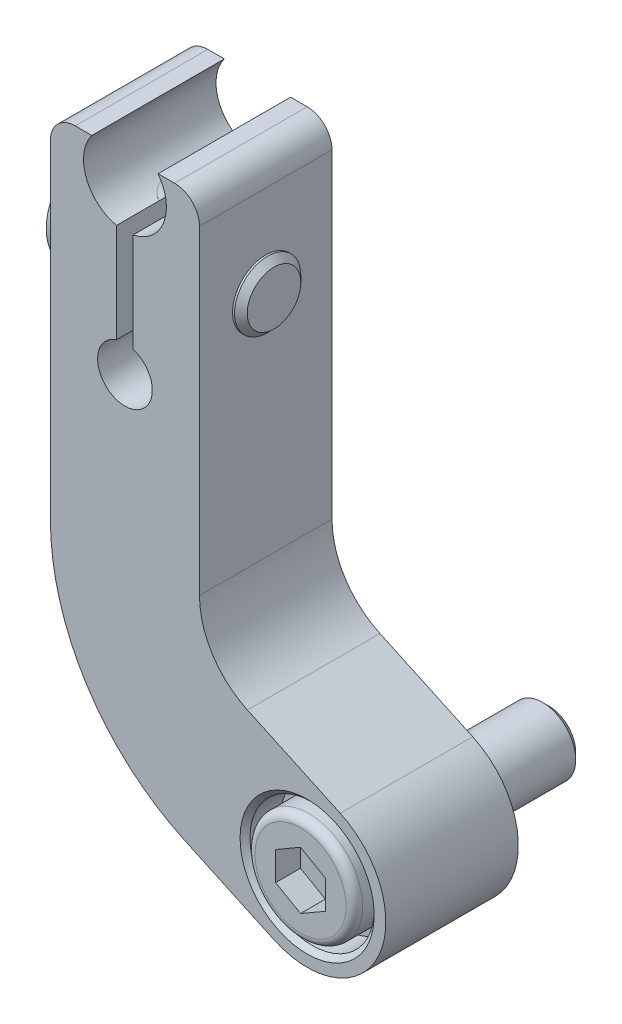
ISO-10303-21;
HEADER;
FILE_DESCRIPTION(('STEP AP214'),'2;1');
FILE_NAME('part.step','',(''),(''),'','','');
FILE_SCHEMA(('AUTOMOTIVE_DESIGN { 1 0 10303 214 1 1 1 1 }'));
ENDSEC;
DATA;
#1=APPLICATION_CONTEXT('core data for automotive mechanical design processes');
#2=APPLICATION_PROTOCOL_DEFINITION('international standard','automotive_design',2000,#1);
#3=PRODUCT_CONTEXT('',#1,'mechanical');
#4=PRODUCT('Part','Part','',(#3));
#5=PRODUCT_RELATED_PRODUCT_CATEGORY('part','',(#4));
#6=PRODUCT_DEFINITION_FORMATION('','',#4);
#7=PRODUCT_DEFINITION_CONTEXT('part definition',#1,'design');
#8=PRODUCT_DEFINITION('design','',#6,#7);
#9=PRODUCT_DEFINITION_SHAPE('','',#8);
#10=(LENGTH_UNIT() NAMED_UNIT(*) SI_UNIT(.MILLI.,.METRE.));
#11=(NAMED_UNIT(*) PLANE_ANGLE_UNIT() SI_UNIT($,.RADIAN.));
#12=(NAMED_UNIT(*) SI_UNIT($,.STERADIAN.) SOLID_ANGLE_UNIT());
#13=UNCERTAINTY_MEASURE_WITH_UNIT(LENGTH_MEASURE(1.E-05),#10,'distance_accuracy_value','');
#14=(GEOMETRIC_REPRESENTATION_CONTEXT(3) GLOBAL_UNCERTAINTY_ASSIGNED_CONTEXT((#13)) GLOBAL_UNIT_ASSIGNED_CONTEXT((#10,
#11,#12)) REPRESENTATION_CONTEXT('',''));
#15=CARTESIAN_POINT('',(0.,0.,0.));
#16=DIRECTION('',(0.,0.,1.));
#17=DIRECTION('',(1.,0.,0.));
#18=AXIS2_PLACEMENT_3D('',#15,#16,#17);
#19=CARTESIAN_POINT('',(-33.,50.5,8.));
#20=DIRECTION('',(1.,0.,0.));
#21=DIRECTION('',(0.,0.,-1.));
#22=AXIS2_PLACEMENT_3D('',#19,#20,#21);
#23=CYLINDRICAL_SURFACE('',#22,6.5);
#24=CARTESIAN_POINT('',(-33.,50.5,8.));
#25=DIRECTION('',(1.,0.,0.));
#26=DIRECTION('',(0.,0.,1.));
#27=AXIS2_PLACEMENT_3D('',#24,#25,#26);
#28=CIRCLE('',#27,6.5);
#29=CARTESIAN_POINT('',(-33.,50.5,14.5));
#30=VERTEX_POINT('',#29);
#31=EDGE_CURVE('E290',#30,#30,#28,.T.);
#32=ORIENTED_EDGE('',*,*,#31,.T.);
#33=EDGE_LOOP('',(#32));
#34=FACE_BOUND('',#33,.T.);
#35=CARTESIAN_POINT('',(-28.,50.5,8.));
#36=DIRECTION('',(1.,0.,0.));
#37=DIRECTION('',(0.,0.,1.));
#38=AXIS2_PLACEMENT_3D('',#35,#36,#37);
#39=CIRCLE('',#38,6.5);
#40=CARTESIAN_POINT('',(-28.,50.5,14.5));
#41=VERTEX_POINT('',#40);
#42=EDGE_CURVE('E279',#41,#41,#39,.T.);
#43=ORIENTED_EDGE('',*,*,#42,.F.);
#44=EDGE_LOOP('',(#43));
#45=FACE_BOUND('',#44,.T.);
#46=ADVANCED_FACE('F14',(#34,#45),#23,.T.);
#47=CARTESIAN_POINT('',(-33.,50.5,8.));
#48=DIRECTION('',(-1.,0.,0.));
#49=DIRECTION('',(0.,0.,1.));
#50=AXIS2_PLACEMENT_3D('',#47,#48,#49);
#51=PLANE('',#50);
#52=DIRECTION('',(0.,-0.500000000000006,-0.866025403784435));
#53=VECTOR('',#52,1.);
#54=CARTESIAN_POINT('',(-33.,53.9641016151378,8.));
#55=LINE('',#54,#53);
#56=CARTESIAN_POINT('',(-33.,53.9641016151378,8.));
#57=VERTEX_POINT('',#56);
#58=CARTESIAN_POINT('',(-33.,52.2320508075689,5.));
#59=VERTEX_POINT('',#58);
#60=EDGE_CURVE('E250',#57,#59,#55,.T.);
#61=ORIENTED_EDGE('',*,*,#60,.F.);
#62=DIRECTION('',(0.,0.500000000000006,-0.866025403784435));
#63=VECTOR('',#62,1.);
#64=CARTESIAN_POINT('',(-33.,52.2320508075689,11.));
#65=LINE('',#64,#63);
#66=CARTESIAN_POINT('',(-33.,52.2320508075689,11.));
#67=VERTEX_POINT('',#66);
#68=EDGE_CURVE('E273',#67,#57,#65,.T.);
#69=ORIENTED_EDGE('',*,*,#68,.F.);
#70=DIRECTION('',(0.,1.,0.));
#71=VECTOR('',#70,1.);
#72=CARTESIAN_POINT('',(-33.,48.7679491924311,11.));
#73=LINE('',#72,#71);
#74=CARTESIAN_POINT('',(-33.,48.7679491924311,11.));
#75=VERTEX_POINT('',#74);
#76=EDGE_CURVE('E270',#75,#67,#73,.T.);
#77=ORIENTED_EDGE('',*,*,#76,.F.);
#78=DIRECTION('',(0.,0.5,0.866025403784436));
#79=VECTOR('',#78,1.);
#80=CARTESIAN_POINT('',(-33.,47.0358983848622,8.));
#81=LINE('',#80,#79);
#82=CARTESIAN_POINT('',(-33.,47.0358983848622,8.));
#83=VERTEX_POINT('',#82);
#84=EDGE_CURVE('E267',#83,#75,#81,.T.);
#85=ORIENTED_EDGE('',*,*,#84,.F.);
#86=DIRECTION('',(0.,-0.5,0.866025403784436));
#87=VECTOR('',#86,1.);
#88=CARTESIAN_POINT('',(-33.,48.7679491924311,5.));
#89=LINE('',#88,#87);
#90=CARTESIAN_POINT('',(-33.,48.7679491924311,5.));
#91=VERTEX_POINT('',#90);
#92=EDGE_CURVE('E259',#91,#83,#89,.T.);
#93=ORIENTED_EDGE('',*,*,#92,.F.);
#94=DIRECTION('',(0.,-1.,0.));
#95=VECTOR('',#94,1.);
#96=CARTESIAN_POINT('',(-33.,52.2320508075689,5.));
#97=LINE('',#96,#95);
#98=EDGE_CURVE('E253',#59,#91,#97,.T.);
#99=ORIENTED_EDGE('',*,*,#98,.F.);
#100=EDGE_LOOP('',(#61,#69,#77,#85,#93,#99));
#101=FACE_BOUND('',#100,.T.);
#102=ORIENTED_EDGE('',*,*,#31,.F.);
#103=EDGE_LOOP('',(#102));
#104=FACE_BOUND('',#103,.T.);
#105=ADVANCED_FACE('F512',(#101,#104),#51,.T.);
#106=CARTESIAN_POINT('',(-30.,53.9641016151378,8.));
#107=DIRECTION('',(0.,0.866025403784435,-0.500000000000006));
#108=DIRECTION('',(0.,0.500000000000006,0.866025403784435));
#109=AXIS2_PLACEMENT_3D('',#106,#107,#108);
#110=PLANE('',#109);
#111=ORIENTED_EDGE('',*,*,#60,.T.);
#112=DIRECTION('',(-1.,0.,0.));
#113=VECTOR('',#112,1.);
#114=CARTESIAN_POINT('',(-30.,52.2320508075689,5.));
#115=LINE('',#114,#113);
#116=CARTESIAN_POINT('',(-30.,52.2320508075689,5.));
#117=VERTEX_POINT('',#116);
#118=EDGE_CURVE('E288',#117,#59,#115,.T.);
#119=ORIENTED_EDGE('',*,*,#118,.F.);
#120=DIRECTION('',(0.,-0.500000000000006,-0.866025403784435));
#121=VECTOR('',#120,1.);
#122=CARTESIAN_POINT('',(-30.,53.9641016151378,8.));
#123=LINE('',#122,#121);
#124=CARTESIAN_POINT('',(-30.,53.9641016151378,8.));
#125=VERTEX_POINT('',#124);
#126=EDGE_CURVE('E276',#125,#117,#123,.T.);
#127=ORIENTED_EDGE('',*,*,#126,.F.);
#128=DIRECTION('',(-1.,0.,0.));
#129=VECTOR('',#128,1.);
#130=CARTESIAN_POINT('',(-30.,53.9641016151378,8.));
#131=LINE('',#130,#129);
#132=EDGE_CURVE('E277',#125,#57,#131,.T.);
#133=ORIENTED_EDGE('',*,*,#132,.T.);
#134=EDGE_LOOP('',(#111,#119,#127,#133));
#135=FACE_BOUND('',#134,.T.);
#136=ADVANCED_FACE('F518',(#135),#110,.F.);
#137=CARTESIAN_POINT('',(-30.,52.2320508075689,11.));
#138=DIRECTION('',(0.,0.866025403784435,0.500000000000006));
#139=DIRECTION('',(0.,-0.500000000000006,0.866025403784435));
#140=AXIS2_PLACEMENT_3D('',#137,#138,#139);
#141=PLANE('',#140);
#142=ORIENTED_EDGE('',*,*,#68,.T.);
#143=ORIENTED_EDGE('',*,*,#132,.F.);
#144=DIRECTION('',(0.,0.500000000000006,-0.866025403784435));
#145=VECTOR('',#144,1.);
#146=CARTESIAN_POINT('',(-30.,52.2320508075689,11.));
#147=LINE('',#146,#145);
#148=CARTESIAN_POINT('',(-30.,52.2320508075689,11.));
#149=VERTEX_POINT('',#148);
#150=EDGE_CURVE('E262',#149,#125,#147,.T.);
#151=ORIENTED_EDGE('',*,*,#150,.F.);
#152=DIRECTION('',(-1.,0.,0.));
#153=VECTOR('',#152,1.);
#154=CARTESIAN_POINT('',(-30.,52.2320508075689,11.));
#155=LINE('',#154,#153);
#156=EDGE_CURVE('E280',#149,#67,#155,.T.);
#157=ORIENTED_EDGE('',*,*,#156,.T.);
#158=EDGE_LOOP('',(#142,#143,#151,#157));
#159=FACE_BOUND('',#158,.T.);
#160=ADVANCED_FACE('F528',(#159),#141,.F.);
#161=CARTESIAN_POINT('',(-30.,48.7679491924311,11.));
#162=DIRECTION('',(0.,0.,1.));
#163=DIRECTION('',(1.,0.,0.));
#164=AXIS2_PLACEMENT_3D('',#161,#162,#163);
#165=PLANE('',#164);
#166=ORIENTED_EDGE('',*,*,#76,.T.);
#167=ORIENTED_EDGE('',*,*,#156,.F.);
#168=DIRECTION('',(0.,1.,0.));
#169=VECTOR('',#168,1.);
#170=CARTESIAN_POINT('',(-30.,48.7679491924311,11.));
#171=LINE('',#170,#169);
#172=CARTESIAN_POINT('',(-30.,48.7679491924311,11.));
#173=VERTEX_POINT('',#172);
#174=EDGE_CURVE('E567',#173,#149,#171,.T.);
#175=ORIENTED_EDGE('',*,*,#174,.F.);
#176=DIRECTION('',(-1.,0.,0.));
#177=VECTOR('',#176,1.);
#178=CARTESIAN_POINT('',(-30.,48.7679491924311,11.));
#179=LINE('',#178,#177);
#180=EDGE_CURVE('E282',#173,#75,#179,.T.);
#181=ORIENTED_EDGE('',*,*,#180,.T.);
#182=EDGE_LOOP('',(#166,#167,#175,#181));
#183=FACE_BOUND('',#182,.T.);
#184=ADVANCED_FACE('F541',(#183),#165,.F.);
#185=CARTESIAN_POINT('',(-30.,47.0358983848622,8.));
#186=DIRECTION('',(0.,-0.866025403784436,0.5));
#187=DIRECTION('',(0.,-0.5,-0.866025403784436));
#188=AXIS2_PLACEMENT_3D('',#185,#186,#187);
#189=PLANE('',#188);
#190=ORIENTED_EDGE('',*,*,#84,.T.);
#191=ORIENTED_EDGE('',*,*,#180,.F.);
#192=DIRECTION('',(0.,0.5,0.866025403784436));
#193=VECTOR('',#192,1.);
#194=CARTESIAN_POINT('',(-30.,47.0358983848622,8.));
#195=LINE('',#194,#193);
#196=CARTESIAN_POINT('',(-30.,47.0358983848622,8.));
#197=VERTEX_POINT('',#196);
#198=EDGE_CURVE('E568',#197,#173,#195,.T.);
#199=ORIENTED_EDGE('',*,*,#198,.F.);
#200=DIRECTION('',(-1.,0.,0.));
#201=VECTOR('',#200,1.);
#202=CARTESIAN_POINT('',(-30.,47.0358983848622,8.));
#203=LINE('',#202,#201);
#204=EDGE_CURVE('E284',#197,#83,#203,.T.);
#205=ORIENTED_EDGE('',*,*,#204,.T.);
#206=EDGE_LOOP('',(#190,#191,#199,#205));
#207=FACE_BOUND('',#206,.T.);
#208=ADVANCED_FACE('F537',(#207),#189,.F.);
#209=CARTESIAN_POINT('',(-30.,48.7679491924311,5.));
#210=DIRECTION('',(0.,-0.866025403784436,-0.5));
#211=DIRECTION('',(0.,0.5,-0.866025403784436));
#212=AXIS2_PLACEMENT_3D('',#209,#210,#211);
#213=PLANE('',#212);
#214=ORIENTED_EDGE('',*,*,#92,.T.);
#215=ORIENTED_EDGE('',*,*,#204,.F.);
#216=DIRECTION('',(0.,-0.5,0.866025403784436));
#217=VECTOR('',#216,1.);
#218=CARTESIAN_POINT('',(-30.,48.7679491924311,5.));
#219=LINE('',#218,#217);
#220=CARTESIAN_POINT('',(-30.,48.7679491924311,5.));
#221=VERTEX_POINT('',#220);
#222=EDGE_CURVE('E569',#221,#197,#219,.T.);
#223=ORIENTED_EDGE('',*,*,#222,.F.);
#224=DIRECTION('',(-1.,0.,0.));
#225=VECTOR('',#224,1.);
#226=CARTESIAN_POINT('',(-30.,48.7679491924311,5.));
#227=LINE('',#226,#225);
#228=EDGE_CURVE('E286',#221,#91,#227,.T.);
#229=ORIENTED_EDGE('',*,*,#228,.T.);
#230=EDGE_LOOP('',(#214,#215,#223,#229));
#231=FACE_BOUND('',#230,.T.);
#232=ADVANCED_FACE('F533',(#231),#213,.F.);
#233=CARTESIAN_POINT('',(-30.,52.2320508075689,5.));
#234=DIRECTION('',(0.,0.,-1.));
#235=DIRECTION('',(-1.,0.,0.));
#236=AXIS2_PLACEMENT_3D('',#233,#234,#235);
#237=PLANE('',#236);
#238=ORIENTED_EDGE('',*,*,#98,.T.);
#239=ORIENTED_EDGE('',*,*,#228,.F.);
#240=DIRECTION('',(0.,-1.,0.));
#241=VECTOR('',#240,1.);
#242=CARTESIAN_POINT('',(-30.,52.2320508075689,5.));
#243=LINE('',#242,#241);
#244=EDGE_CURVE('E561',#117,#221,#243,.T.);
#245=ORIENTED_EDGE('',*,*,#244,.F.);
#246=ORIENTED_EDGE('',*,*,#118,.T.);
#247=EDGE_LOOP('',(#238,#239,#245,#246));
#248=FACE_BOUND('',#247,.T.);
#249=ADVANCED_FACE('F508',(#248),#237,.F.);
#250=CARTESIAN_POINT('',(-30.,0.,0.));
#251=DIRECTION('',(-1.,0.,0.));
#252=DIRECTION('',(0.,0.,1.));
#253=AXIS2_PLACEMENT_3D('',#250,#251,#252);
#254=PLANE('',#253);
#255=ORIENTED_EDGE('',*,*,#126,.T.);
#256=ORIENTED_EDGE('',*,*,#244,.T.);
#257=ORIENTED_EDGE('',*,*,#222,.T.);
#258=ORIENTED_EDGE('',*,*,#198,.T.);
#259=ORIENTED_EDGE('',*,*,#174,.T.);
#260=ORIENTED_EDGE('',*,*,#150,.T.);
#261=EDGE_LOOP('',(#255,#256,#257,#258,#259,#260));
#262=FACE_BOUND('',#261,.T.);
#263=ADVANCED_FACE('F501',(#262),#254,.T.);
#264=CARTESIAN_POINT('',(-28.,50.5,8.));
#265=DIRECTION('',(1.,0.,0.));
#266=DIRECTION('',(0.,1.,0.));
#267=AXIS2_PLACEMENT_3D('',#264,#265,#266);
#268=PLANE('',#267);
#269=ORIENTED_EDGE('',*,*,#42,.T.);
#270=EDGE_LOOP('',(#269));
#271=FACE_BOUND('',#270,.T.);
#272=CARTESIAN_POINT('',(-28.,50.5,8.));
#273=DIRECTION('',(1.,0.,0.));
#274=DIRECTION('',(0.,1.,0.));
#275=AXIS2_PLACEMENT_3D('',#272,#273,#274);
#276=CIRCLE('',#275,6.75);
#277=CARTESIAN_POINT('',(-28.,57.25,8.));
#278=VERTEX_POINT('',#277);
#279=EDGE_CURVE('E246',#278,#278,#276,.T.);
#280=ORIENTED_EDGE('',*,*,#279,.F.);
#281=EDGE_LOOP('',(#280));
#282=FACE_BOUND('',#281,.T.);
#283=ADVANCED_FACE('F399',(#271,#282),#268,.F.);
#284=CARTESIAN_POINT('',(-31.,50.5,8.));
#285=DIRECTION('',(-1.,0.,0.));
#286=DIRECTION('',(0.,0.,1.));
#287=AXIS2_PLACEMENT_3D('',#284,#285,#286);
#288=CYLINDRICAL_SURFACE('',#287,6.75);
#289=CARTESIAN_POINT('',(-31.,50.5,8.));
#290=DIRECTION('',(-1.,0.,0.));
#291=DIRECTION('',(0.,0.,1.));
#292=AXIS2_PLACEMENT_3D('',#289,#290,#291);
#293=CIRCLE('',#292,6.75);
#294=CARTESIAN_POINT('',(-31.,50.5,14.75));
#295=VERTEX_POINT('',#294);
#296=EDGE_CURVE('E1102',#295,#295,#293,.T.);
#297=ORIENTED_EDGE('',*,*,#296,.T.);
#298=EDGE_LOOP('',(#297));
#299=FACE_BOUND('',#298,.T.);
#300=ORIENTED_EDGE('',*,*,#279,.T.);
#301=EDGE_LOOP('',(#300));
#302=FACE_BOUND('',#301,.T.);
#303=ADVANCED_FACE('F394',(#299,#302),#288,.F.);
#304=CARTESIAN_POINT('',(-31.,64.5,16.));
#305=DIRECTION('',(0.,1.,0.));
#306=DIRECTION('',(0.,0.,1.));
#307=AXIS2_PLACEMENT_3D('',#304,#305,#306);
#308=PLANE('',#307);
#309=DIRECTION('',(1.,0.,0.));
#310=VECTOR('',#309,1.);
#311=CARTESIAN_POINT('',(-31.,64.5,16.));
#312=LINE('',#311,#310);
#313=CARTESIAN_POINT('',(-18.,64.5,16.));
#314=VERTEX_POINT('',#313);
#315=CARTESIAN_POINT('',(-16.,64.5,16.));
#316=VERTEX_POINT('',#315);
#317=EDGE_CURVE('E928',#314,#316,#312,.T.);
#318=ORIENTED_EDGE('',*,*,#317,.T.);
#319=DIRECTION('',(0.,0.,-1.));
#320=VECTOR('',#319,1.);
#321=CARTESIAN_POINT('',(-16.,64.5,16.));
#322=LINE('',#321,#320);
#323=CARTESIAN_POINT('',(-16.,64.5,0.));
#324=VERTEX_POINT('',#323);
#325=EDGE_CURVE('E1018',#316,#324,#322,.T.);
#326=ORIENTED_EDGE('',*,*,#325,.T.);
#327=DIRECTION('',(1.,0.,0.));
#328=VECTOR('',#327,1.);
#329=CARTESIAN_POINT('',(-31.,64.5,0.));
#330=LINE('',#329,#328);
#331=CARTESIAN_POINT('',(-18.,64.5,0.));
#332=VERTEX_POINT('',#331);
#333=EDGE_CURVE('E931',#332,#324,#330,.T.);
#334=ORIENTED_EDGE('',*,*,#333,.F.);
#335=DIRECTION('',(0.,0.,1.));
#336=VECTOR('',#335,1.);
#337=CARTESIAN_POINT('',(-18.,64.5,0.));
#338=LINE('',#337,#336);
#339=EDGE_CURVE('E917',#332,#314,#338,.T.);
#340=ORIENTED_EDGE('',*,*,#339,.T.);
#341=EDGE_LOOP('',(#318,#326,#334,#340));
#342=FACE_BOUND('',#341,.T.);
#343=ADVANCED_FACE('F398',(#342),#308,.T.);
#344=CARTESIAN_POINT('',(-31.,3.90346044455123,16.));
#345=DIRECTION('',(-1.,0.,0.));
#346=DIRECTION('',(0.,0.,1.));
#347=AXIS2_PLACEMENT_3D('',#344,#345,#346);
#348=PLANE('',#347);
#349=ORIENTED_EDGE('',*,*,#296,.F.);
#350=EDGE_LOOP('',(#349));
#351=FACE_BOUND('',#350,.T.);
#352=DIRECTION('',(0.,1.,0.));
#353=VECTOR('',#352,1.);
#354=CARTESIAN_POINT('',(-31.,3.90346044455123,0.));
#355=LINE('',#354,#353);
#356=CARTESIAN_POINT('',(-31.,21.7834124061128,0.));
#357=VERTEX_POINT('',#356);
#358=CARTESIAN_POINT('',(-31.,61.5,0.));
#359=VERTEX_POINT('',#358);
#360=EDGE_CURVE('E956',#357,#359,#355,.T.);
#361=ORIENTED_EDGE('',*,*,#360,.F.);
#362=DIRECTION('',(0.,0.,-1.));
#363=VECTOR('',#362,1.);
#364=CARTESIAN_POINT('',(-31.,21.7834124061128,16.));
#365=LINE('',#364,#363);
#366=CARTESIAN_POINT('',(-31.,21.7834124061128,16.));
#367=VERTEX_POINT('',#366);
#368=EDGE_CURVE('E1036',#357,#367,#365,.F.);
#369=ORIENTED_EDGE('',*,*,#368,.T.);
#370=DIRECTION('',(0.,1.,0.));
#371=VECTOR('',#370,1.);
#372=CARTESIAN_POINT('',(-31.,3.90346044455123,16.));
#373=LINE('',#372,#371);
#374=CARTESIAN_POINT('',(-31.,61.5,16.));
#375=VERTEX_POINT('',#374);
#376=EDGE_CURVE('E938',#367,#375,#373,.T.);
#377=ORIENTED_EDGE('',*,*,#376,.T.);
#378=DIRECTION('',(0.,0.,-1.));
#379=VECTOR('',#378,1.);
#380=CARTESIAN_POINT('',(-31.,61.5,16.));
#381=LINE('',#380,#379);
#382=EDGE_CURVE('E1005',#375,#359,#381,.T.);
#383=ORIENTED_EDGE('',*,*,#382,.T.);
#384=EDGE_LOOP('',(#361,#369,#377,#383));
#385=FACE_BOUND('',#384,.T.);
#386=ADVANCED_FACE('F441',(#351,#385),#348,.T.);
#387=CARTESIAN_POINT('',(-3.99651061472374,-8.61846290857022,16.));
#388=DIRECTION('',(-0.420685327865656,-0.907206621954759,0.));
#389=DIRECTION('',(0.907206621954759,-0.420685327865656,0.));
#390=AXIS2_PLACEMENT_3D('',#387,#388,#389);
#391=PLANE('',#390);
#392=DIRECTION('',(-0.907206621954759,0.420685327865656,0.));
#393=VECTOR('',#392,1.);
#394=CARTESIAN_POINT('',(-3.99651061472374,-8.61846290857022,16.));
#395=LINE('',#394,#393);
#396=CARTESIAN_POINT('',(-3.99651061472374,-8.61846290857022,16.));
#397=VERTEX_POINT('',#396);
#398=CARTESIAN_POINT('',(-14.7791891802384,-3.61837300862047,16.));
#399=VERTEX_POINT('',#398);
#400=EDGE_CURVE('E952',#397,#399,#395,.T.);
#401=ORIENTED_EDGE('',*,*,#400,.T.);
#402=DIRECTION('',(0.,0.,-1.));
#403=VECTOR('',#402,1.);
#404=CARTESIAN_POINT('',(-14.7791891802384,-3.61837300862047,16.));
#405=LINE('',#404,#403);
#406=CARTESIAN_POINT('',(-14.7791891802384,-3.61837300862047,0.));
#407=VERTEX_POINT('',#406);
#408=EDGE_CURVE('E1031',#399,#407,#405,.T.);
#409=ORIENTED_EDGE('',*,*,#408,.T.);
#410=DIRECTION('',(-0.907206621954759,0.420685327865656,0.));
#411=VECTOR('',#410,1.);
#412=CARTESIAN_POINT('',(-3.99651061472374,-8.61846290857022,0.));
#413=LINE('',#412,#411);
#414=CARTESIAN_POINT('',(-3.99651061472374,-8.61846290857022,0.));
#415=VERTEX_POINT('',#414);
#416=EDGE_CURVE('E941',#415,#407,#413,.T.);
#417=ORIENTED_EDGE('',*,*,#416,.F.);
#418=DIRECTION('',(0.,0.,-1.));
#419=VECTOR('',#418,1.);
#420=CARTESIAN_POINT('',(-3.99651061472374,-8.61846290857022,16.));
#421=LINE('',#420,#419);
#422=EDGE_CURVE('E971',#397,#415,#421,.T.);
#423=ORIENTED_EDGE('',*,*,#422,.F.);
#424=EDGE_LOOP('',(#401,#409,#417,#423));
#425=FACE_BOUND('',#424,.T.);
#426=ADVANCED_FACE('F437',(#425),#391,.T.);
#427=CARTESIAN_POINT('',(0.,0.,16.));
#428=DIRECTION('',(0.,0.,-1.));
#429=DIRECTION('',(-1.,0.,0.));
#430=AXIS2_PLACEMENT_3D('',#427,#428,#429);
#431=CYLINDRICAL_SURFACE('',#430,9.5);
#432=CARTESIAN_POINT('',(0.,0.,0.));
#433=DIRECTION('',(0.,0.,-1.));
#434=DIRECTION('',(-1.,0.,0.));
#435=AXIS2_PLACEMENT_3D('',#432,#433,#434);
#436=CIRCLE('',#435,9.5);
#437=CARTESIAN_POINT('',(3.99651061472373,8.61846290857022,0.));
#438=VERTEX_POINT('',#437);
#439=EDGE_CURVE('E966',#438,#415,#436,.T.);
#440=ORIENTED_EDGE('',*,*,#439,.F.);
#441=DIRECTION('',(0.,0.,-1.));
#442=VECTOR('',#441,1.);
#443=CARTESIAN_POINT('',(3.99651061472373,8.61846290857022,16.));
#444=LINE('',#443,#442);
#445=CARTESIAN_POINT('',(3.99651061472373,8.61846290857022,16.));
#446=VERTEX_POINT('',#445);
#447=EDGE_CURVE('E955',#446,#438,#444,.T.);
#448=ORIENTED_EDGE('',*,*,#447,.F.);
#449=CARTESIAN_POINT('',(0.,0.,16.));
#450=DIRECTION('',(0.,0.,-1.));
#451=DIRECTION('',(-1.,0.,0.));
#452=AXIS2_PLACEMENT_3D('',#449,#450,#451);
#453=CIRCLE('',#452,9.5);
#454=EDGE_CURVE('E949',#446,#397,#453,.T.);
#455=ORIENTED_EDGE('',*,*,#454,.T.);
#456=ORIENTED_EDGE('',*,*,#422,.T.);
#457=EDGE_LOOP('',(#440,#448,#455,#456));
#458=FACE_BOUND('',#457,.T.);
#459=ADVANCED_FACE('F440',(#458),#431,.T.);
#460=CARTESIAN_POINT('',(-13.,16.5,16.));
#461=DIRECTION('',(0.420685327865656,0.907206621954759,0.));
#462=DIRECTION('',(-0.907206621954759,0.420685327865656,0.));
#463=AXIS2_PLACEMENT_3D('',#460,#461,#462);
#464=PLANE('',#463);
#465=DIRECTION('',(0.907206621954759,-0.420685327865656,0.));
#466=VECTOR('',#465,1.);
#467=CARTESIAN_POINT('',(-13.,16.5,0.));
#468=LINE('',#467,#466);
#469=CARTESIAN_POINT('',(-7.20685327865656,13.8136309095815,0.));
#470=VERTEX_POINT('',#469);
#471=EDGE_CURVE('E964',#470,#438,#468,.T.);
#472=ORIENTED_EDGE('',*,*,#471,.F.);
#473=DIRECTION('',(0.,0.,-1.));
#474=VECTOR('',#473,1.);
#475=CARTESIAN_POINT('',(-7.20685327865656,13.8136309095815,16.));
#476=LINE('',#475,#474);
#477=CARTESIAN_POINT('',(-7.20685327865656,13.8136309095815,16.));
#478=VERTEX_POINT('',#477);
#479=EDGE_CURVE('E1025',#470,#478,#476,.F.);
#480=ORIENTED_EDGE('',*,*,#479,.T.);
#481=DIRECTION('',(0.907206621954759,-0.420685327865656,0.));
#482=VECTOR('',#481,1.);
#483=CARTESIAN_POINT('',(-13.,16.5,16.));
#484=LINE('',#483,#482);
#485=EDGE_CURVE('E947',#478,#446,#484,.T.);
#486=ORIENTED_EDGE('',*,*,#485,.T.);
#487=ORIENTED_EDGE('',*,*,#447,.T.);
#488=EDGE_LOOP('',(#472,#480,#486,#487));
#489=FACE_BOUND('',#488,.T.);
#490=ADVANCED_FACE('F445',(#489),#464,.T.);
#491=CARTESIAN_POINT('',(-13.,64.5,16.));
#492=DIRECTION('',(1.,0.,0.));
#493=DIRECTION('',(0.,1.,0.));
#494=AXIS2_PLACEMENT_3D('',#491,#492,#493);
#495=PLANE('',#494);
#496=CARTESIAN_POINT('',(-13.,50.5,8.));
#497=DIRECTION('',(1.,0.,0.));
#498=DIRECTION('',(0.,1.,0.));
#499=AXIS2_PLACEMENT_3D('',#496,#497,#498);
#500=CIRCLE('',#499,4.);
#501=CARTESIAN_POINT('',(-13.,54.5,8.));
#502=VERTEX_POINT('',#501);
#503=EDGE_CURVE('E978',#502,#502,#500,.T.);
#504=ORIENTED_EDGE('',*,*,#503,.F.);
#505=EDGE_LOOP('',(#504));
#506=FACE_BOUND('',#505,.T.);
#507=DIRECTION('',(0.,-1.,0.));
#508=VECTOR('',#507,1.);
#509=CARTESIAN_POINT('',(-13.,64.5,16.));
#510=LINE('',#509,#508);
#511=CARTESIAN_POINT('',(-13.,61.5,16.));
#512=VERTEX_POINT('',#511);
#513=CARTESIAN_POINT('',(-13.,22.8856971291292,16.));
#514=VERTEX_POINT('',#513);
#515=EDGE_CURVE('E940',#512,#514,#510,.T.);
#516=ORIENTED_EDGE('',*,*,#515,.T.);
#517=DIRECTION('',(0.,0.,-1.));
#518=VECTOR('',#517,1.);
#519=CARTESIAN_POINT('',(-13.,22.8856971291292,0.));
#520=LINE('',#519,#518);
#521=CARTESIAN_POINT('',(-13.,22.8856971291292,0.));
#522=VERTEX_POINT('',#521);
#523=EDGE_CURVE('E1022',#514,#522,#520,.T.);
#524=ORIENTED_EDGE('',*,*,#523,.T.);
#525=DIRECTION('',(0.,-1.,0.));
#526=VECTOR('',#525,1.);
#527=CARTESIAN_POINT('',(-13.,64.5,0.));
#528=LINE('',#527,#526);
#529=CARTESIAN_POINT('',(-13.,61.5,0.));
#530=VERTEX_POINT('',#529);
#531=EDGE_CURVE('E961',#530,#522,#528,.T.);
#532=ORIENTED_EDGE('',*,*,#531,.F.);
#533=DIRECTION('',(0.,0.,-1.));
#534=VECTOR('',#533,1.);
#535=CARTESIAN_POINT('',(-13.,61.5,16.));
#536=LINE('',#535,#534);
#537=EDGE_CURVE('E1020',#530,#512,#536,.F.);
#538=ORIENTED_EDGE('',*,*,#537,.T.);
#539=EDGE_LOOP('',(#516,#524,#532,#538));
#540=FACE_BOUND('',#539,.T.);
#541=ADVANCED_FACE('F449',(#506,#540),#495,.T.);
#542=CARTESIAN_POINT('',(-28.,64.5,0.));
#543=VERTEX_POINT('',#542);
#544=CARTESIAN_POINT('',(-26.,64.5,0.));
#545=VERTEX_POINT('',#544);
#546=EDGE_CURVE('E959',#543,#545,#330,.T.);
#547=ORIENTED_EDGE('',*,*,#546,.F.);
#548=DIRECTION('',(0.,0.,-1.));
#549=VECTOR('',#548,1.);
#550=CARTESIAN_POINT('',(-28.,64.5,16.));
#551=LINE('',#550,#549);
#552=CARTESIAN_POINT('',(-28.,64.5,16.));
#553=VERTEX_POINT('',#552);
#554=EDGE_CURVE('E1012',#543,#553,#551,.F.);
#555=ORIENTED_EDGE('',*,*,#554,.T.);
#556=CARTESIAN_POINT('',(-26.,64.5,16.));
#557=VERTEX_POINT('',#556);
#558=EDGE_CURVE('E937',#553,#557,#312,.T.);
#559=ORIENTED_EDGE('',*,*,#558,.T.);
#560=DIRECTION('',(0.,0.,1.));
#561=VECTOR('',#560,1.);
#562=CARTESIAN_POINT('',(-26.,64.5,0.));
#563=LINE('',#562,#561);
#564=EDGE_CURVE('E1061',#545,#557,#563,.T.);
#565=ORIENTED_EDGE('',*,*,#564,.F.);
#566=EDGE_LOOP('',(#547,#555,#559,#565));
#567=FACE_BOUND('',#566,.T.);
#568=ADVANCED_FACE('F432',(#567),#308,.T.);
#569=CARTESIAN_POINT('',(0.,0.,16.));
#570=DIRECTION('',(0.,0.,-1.));
#571=DIRECTION('',(-1.,0.,0.));
#572=AXIS2_PLACEMENT_3D('',#569,#570,#571);
#573=PLANE('',#572);
#574=CARTESIAN_POINT('',(0.,0.,16.));
#575=DIRECTION('',(0.,0.,-1.));
#576=DIRECTION('',(-1.,0.,0.));
#577=AXIS2_PLACEMENT_3D('',#574,#575,#576);
#578=CIRCLE('',#577,8.1);
#579=CARTESIAN_POINT('',(-8.1,0.,16.));
#580=VERTEX_POINT('',#579);
#581=EDGE_CURVE('E984',#580,#580,#578,.T.);
#582=ORIENTED_EDGE('',*,*,#581,.T.);
#583=EDGE_LOOP('',(#582));
#584=FACE_BOUND('',#583,.T.);
#585=ORIENTED_EDGE('',*,*,#376,.F.);
#586=CARTESIAN_POINT('',(-3.,21.7834124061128,16.));
#587=DIRECTION('',(0.,0.,-1.));
#588=DIRECTION('',(-1.,0.,0.));
#589=AXIS2_PLACEMENT_3D('',#586,#587,#588);
#590=CIRCLE('',#589,28.);
#591=EDGE_CURVE('E1038',#367,#399,#590,.F.);
#592=ORIENTED_EDGE('',*,*,#591,.T.);
#593=ORIENTED_EDGE('',*,*,#400,.F.);
#594=ORIENTED_EDGE('',*,*,#454,.F.);
#595=ORIENTED_EDGE('',*,*,#485,.F.);
#596=CARTESIAN_POINT('',(-3.,22.8856971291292,16.));
#597=DIRECTION('',(0.,0.,-1.));
#598=DIRECTION('',(-1.,0.,0.));
#599=AXIS2_PLACEMENT_3D('',#596,#597,#598);
#600=CIRCLE('',#599,10.);
#601=EDGE_CURVE('E1029',#478,#514,#600,.T.);
#602=ORIENTED_EDGE('',*,*,#601,.T.);
#603=ORIENTED_EDGE('',*,*,#515,.F.);
#604=CARTESIAN_POINT('',(-16.,61.5,16.));
#605=DIRECTION('',(0.,0.,-1.));
#606=DIRECTION('',(-1.,0.,0.));
#607=AXIS2_PLACEMENT_3D('',#604,#605,#606);
#608=CIRCLE('',#607,3.);
#609=EDGE_CURVE('E936',#512,#316,#608,.F.);
#610=ORIENTED_EDGE('',*,*,#609,.T.);
#611=ORIENTED_EDGE('',*,*,#317,.F.);
#612=CARTESIAN_POINT('',(-22.,61.5,16.));
#613=DIRECTION('',(0.,0.,1.));
#614=DIRECTION('',(1.,0.,0.));
#615=AXIS2_PLACEMENT_3D('',#612,#613,#614);
#616=CIRCLE('',#615,5.);
#617=CARTESIAN_POINT('',(-21.,56.6010205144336,16.));
#618=VERTEX_POINT('',#617);
#619=EDGE_CURVE('E417',#618,#314,#616,.T.);
#620=ORIENTED_EDGE('',*,*,#619,.F.);
#621=DIRECTION('',(0.,1.,0.));
#622=VECTOR('',#621,1.);
#623=CARTESIAN_POINT('',(-21.,44.6448370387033,16.));
#624=LINE('',#623,#622);
#625=CARTESIAN_POINT('',(-21.,44.6448370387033,16.));
#626=VERTEX_POINT('',#625);
#627=EDGE_CURVE('E1080',#626,#618,#624,.T.);
#628=ORIENTED_EDGE('',*,*,#627,.F.);
#629=CARTESIAN_POINT('',(-22.,41.5,16.));
#630=DIRECTION('',(0.,0.,1.));
#631=DIRECTION('',(1.,0.,0.));
#632=AXIS2_PLACEMENT_3D('',#629,#630,#631);
#633=CIRCLE('',#632,3.3);
#634=CARTESIAN_POINT('',(-23.,44.6448370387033,16.));
#635=VERTEX_POINT('',#634);
#636=EDGE_CURVE('E1068',#635,#626,#633,.T.);
#637=ORIENTED_EDGE('',*,*,#636,.F.);
#638=DIRECTION('',(0.,-1.,0.));
#639=VECTOR('',#638,1.);
#640=CARTESIAN_POINT('',(-23.,64.5,16.));
#641=LINE('',#640,#639);
#642=CARTESIAN_POINT('',(-23.,56.6010205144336,16.));
#643=VERTEX_POINT('',#642);
#644=EDGE_CURVE('E1064',#643,#635,#641,.T.);
#645=ORIENTED_EDGE('',*,*,#644,.F.);
#646=CARTESIAN_POINT('',(-22.,61.5,16.));
#647=DIRECTION('',(0.,0.,1.));
#648=DIRECTION('',(1.,0.,0.));
#649=AXIS2_PLACEMENT_3D('',#646,#647,#648);
#650=CIRCLE('',#649,5.);
#651=EDGE_CURVE('E1074',#557,#643,#650,.T.);
#652=ORIENTED_EDGE('',*,*,#651,.F.);
#653=ORIENTED_EDGE('',*,*,#558,.F.);
#654=CARTESIAN_POINT('',(-28.,61.5,16.));
#655=DIRECTION('',(0.,0.,-1.));
#656=DIRECTION('',(-1.,0.,0.));
#657=AXIS2_PLACEMENT_3D('',#654,#655,#656);
#658=CIRCLE('',#657,3.);
#659=EDGE_CURVE('E1015',#553,#375,#658,.F.);
#660=ORIENTED_EDGE('',*,*,#659,.T.);
#661=EDGE_LOOP('',(#585,#592,#593,#594,#595,#602,#603,#610,#611,#620,#628,#637,#645,#652,#653,#660));
#662=FACE_BOUND('',#661,.T.);
#663=ADVANCED_FACE('F428',(#584,#662),#573,.F.);
#664=CARTESIAN_POINT('',(0.,0.,0.));
#665=DIRECTION('',(0.,0.,-1.));
#666=DIRECTION('',(-1.,0.,0.));
#667=AXIS2_PLACEMENT_3D('',#664,#665,#666);
#668=PLANE('',#667);
#669=CARTESIAN_POINT('',(0.,0.,0.));
#670=DIRECTION('',(0.,0.,-1.));
#671=DIRECTION('',(-1.,0.,0.));
#672=AXIS2_PLACEMENT_3D('',#669,#670,#671);
#673=CIRCLE('',#672,5.);
#674=CARTESIAN_POINT('',(-5.,0.,0.));
#675=VERTEX_POINT('',#674);
#676=EDGE_CURVE('E1141',#675,#675,#673,.T.);
#677=ORIENTED_EDGE('',*,*,#676,.F.);
#678=EDGE_LOOP('',(#677));
#679=FACE_BOUND('',#678,.T.);
#680=ORIENTED_EDGE('',*,*,#416,.T.);
#681=CARTESIAN_POINT('',(-3.,21.7834124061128,0.));
#682=DIRECTION('',(0.,0.,-1.));
#683=DIRECTION('',(-1.,0.,0.));
#684=AXIS2_PLACEMENT_3D('',#681,#682,#683);
#685=CIRCLE('',#684,28.);
#686=EDGE_CURVE('E1034',#407,#357,#685,.T.);
#687=ORIENTED_EDGE('',*,*,#686,.T.);
#688=ORIENTED_EDGE('',*,*,#360,.T.);
#689=CARTESIAN_POINT('',(-28.,61.5,0.));
#690=DIRECTION('',(0.,0.,-1.));
#691=DIRECTION('',(-1.,0.,0.));
#692=AXIS2_PLACEMENT_3D('',#689,#690,#691);
#693=CIRCLE('',#692,3.);
#694=EDGE_CURVE('E1010',#359,#543,#693,.T.);
#695=ORIENTED_EDGE('',*,*,#694,.T.);
#696=ORIENTED_EDGE('',*,*,#546,.T.);
#697=CARTESIAN_POINT('',(-22.,61.5,0.));
#698=DIRECTION('',(0.,0.,1.));
#699=DIRECTION('',(1.,0.,0.));
#700=AXIS2_PLACEMENT_3D('',#697,#698,#699);
#701=CIRCLE('',#700,5.);
#702=CARTESIAN_POINT('',(-23.,56.6010205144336,0.));
#703=VERTEX_POINT('',#702);
#704=EDGE_CURVE('E1099',#545,#703,#701,.T.);
#705=ORIENTED_EDGE('',*,*,#704,.T.);
#706=DIRECTION('',(0.,-1.,0.));
#707=VECTOR('',#706,1.);
#708=CARTESIAN_POINT('',(-23.,64.5,0.));
#709=LINE('',#708,#707);
#710=CARTESIAN_POINT('',(-23.,44.6448370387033,0.));
#711=VERTEX_POINT('',#710);
#712=EDGE_CURVE('E1077',#703,#711,#709,.T.);
#713=ORIENTED_EDGE('',*,*,#712,.T.);
#714=CARTESIAN_POINT('',(-22.,41.5,0.));
#715=DIRECTION('',(0.,0.,1.));
#716=DIRECTION('',(1.,0.,0.));
#717=AXIS2_PLACEMENT_3D('',#714,#715,#716);
#718=CIRCLE('',#717,3.3);
#719=CARTESIAN_POINT('',(-21.,44.6448370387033,0.));
#720=VERTEX_POINT('',#719);
#721=EDGE_CURVE('E1079',#711,#720,#718,.T.);
#722=ORIENTED_EDGE('',*,*,#721,.T.);
#723=DIRECTION('',(0.,1.,0.));
#724=VECTOR('',#723,1.);
#725=CARTESIAN_POINT('',(-21.,44.6448370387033,0.));
#726=LINE('',#725,#724);
#727=CARTESIAN_POINT('',(-21.,56.6010205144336,0.));
#728=VERTEX_POINT('',#727);
#729=EDGE_CURVE('E1083',#720,#728,#726,.T.);
#730=ORIENTED_EDGE('',*,*,#729,.T.);
#731=CARTESIAN_POINT('',(-22.,61.5,0.));
#732=DIRECTION('',(0.,0.,1.));
#733=DIRECTION('',(1.,0.,0.));
#734=AXIS2_PLACEMENT_3D('',#731,#732,#733);
#735=CIRCLE('',#734,5.);
#736=EDGE_CURVE('E418',#728,#332,#735,.T.);
#737=ORIENTED_EDGE('',*,*,#736,.T.);
#738=ORIENTED_EDGE('',*,*,#333,.T.);
#739=CARTESIAN_POINT('',(-16.,61.5,0.));
#740=DIRECTION('',(0.,0.,-1.));
#741=DIRECTION('',(-1.,0.,0.));
#742=AXIS2_PLACEMENT_3D('',#739,#740,#741);
#743=CIRCLE('',#742,3.);
#744=EDGE_CURVE('E1008',#324,#530,#743,.T.);
#745=ORIENTED_EDGE('',*,*,#744,.T.);
#746=ORIENTED_EDGE('',*,*,#531,.T.);
#747=CARTESIAN_POINT('',(-3.,22.8856971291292,0.));
#748=DIRECTION('',(0.,0.,-1.));
#749=DIRECTION('',(-1.,0.,0.));
#750=AXIS2_PLACEMENT_3D('',#747,#748,#749);
#751=CIRCLE('',#750,10.);
#752=EDGE_CURVE('E1027',#522,#470,#751,.F.);
#753=ORIENTED_EDGE('',*,*,#752,.T.);
#754=ORIENTED_EDGE('',*,*,#471,.T.);
#755=ORIENTED_EDGE('',*,*,#439,.T.);
#756=EDGE_LOOP('',(#680,#687,#688,#695,#696,#705,#713,#722,#730,#737,#738,#745,#746,#753,#754,#755));
#757=FACE_BOUND('',#756,.T.);
#758=ADVANCED_FACE('F431',(#679,#757),#668,.T.);
#759=CARTESIAN_POINT('',(-21.,44.6448370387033,0.));
#760=DIRECTION('',(1.,0.,0.));
#761=DIRECTION('',(0.,0.,-1.));
#762=AXIS2_PLACEMENT_3D('',#759,#760,#761);
#763=PLANE('',#762);
#764=CARTESIAN_POINT('',(-21.,50.5,8.));
#765=DIRECTION('',(1.,0.,0.));
#766=DIRECTION('',(0.,0.,-1.));
#767=AXIS2_PLACEMENT_3D('',#764,#765,#766);
#768=CIRCLE('',#767,4.);
#769=CARTESIAN_POINT('',(-21.,50.5,4.));
#770=VERTEX_POINT('',#769);
#771=EDGE_CURVE('E238',#770,#770,#768,.T.);
#772=ORIENTED_EDGE('',*,*,#771,.T.);
#773=EDGE_LOOP('',(#772));
#774=FACE_BOUND('',#773,.T.);
#775=ORIENTED_EDGE('',*,*,#627,.T.);
#776=DIRECTION('',(0.,0.,1.));
#777=VECTOR('',#776,1.);
#778=CARTESIAN_POINT('',(-21.,56.6010205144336,0.));
#779=LINE('',#778,#777);
#780=EDGE_CURVE('E920',#728,#618,#779,.T.);
#781=ORIENTED_EDGE('',*,*,#780,.F.);
#782=ORIENTED_EDGE('',*,*,#729,.F.);
#783=DIRECTION('',(0.,0.,1.));
#784=VECTOR('',#783,1.);
#785=CARTESIAN_POINT('',(-21.,44.6448370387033,0.));
#786=LINE('',#785,#784);
#787=EDGE_CURVE('E958',#720,#626,#786,.T.);
#788=ORIENTED_EDGE('',*,*,#787,.T.);
#789=EDGE_LOOP('',(#775,#781,#782,#788));
#790=FACE_BOUND('',#789,.T.);
#791=ADVANCED_FACE('F426',(#774,#790),#763,.F.);
#792=CARTESIAN_POINT('',(-22.,41.5,0.));
#793=DIRECTION('',(0.,0.,1.));
#794=DIRECTION('',(1.,0.,0.));
#795=AXIS2_PLACEMENT_3D('',#792,#793,#794);
#796=CYLINDRICAL_SURFACE('',#795,3.3);
#797=DIRECTION('',(0.,0.,1.));
#798=VECTOR('',#797,1.);
#799=CARTESIAN_POINT('',(-23.,44.6448370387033,0.));
#800=LINE('',#799,#798);
#801=CARTESIAN_POINT('',(-23.,44.6448370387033,4.64149338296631));
#802=VERTEX_POINT('',#801);
#803=EDGE_CURVE('E1090',#711,#802,#800,.T.);
#804=ORIENTED_EDGE('',*,*,#803,.T.);
#805=CARTESIAN_POINT('',(-23.,44.6448370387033,4.6414933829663));
#806=CARTESIAN_POINT('',(-23.0650311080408,44.6241654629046,4.67752058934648));
#807=CARTESIAN_POINT('',(-23.1276524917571,44.6020258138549,4.71689838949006));
#808=CARTESIAN_POINT('',(-23.2477442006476,44.5556921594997,4.80156193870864));
#809=CARTESIAN_POINT('',(-23.3052250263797,44.5315025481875,4.84683515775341));
#810=CARTESIAN_POINT('',(-23.414302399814,44.4821628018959,4.94206332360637));
#811=CARTESIAN_POINT('',(-23.4659626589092,44.4570281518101,4.99195379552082));
#812=CARTESIAN_POINT('',(-23.5642528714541,44.4062298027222,5.09623662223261));
#813=CARTESIAN_POINT('',(-23.6108802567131,44.3805658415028,5.15063125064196));
#814=CARTESIAN_POINT('',(-23.7426447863,44.3041867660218,5.31870052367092));
#815=CARTESIAN_POINT('',(-23.8206219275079,44.2536258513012,5.43812273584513));
#816=CARTESIAN_POINT('',(-23.9594062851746,44.1566779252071,5.68852629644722));
#817=CARTESIAN_POINT('',(-24.0201468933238,44.1103075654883,5.81954998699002));
#818=CARTESIAN_POINT('',(-24.1148299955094,44.0338350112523,6.06002847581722));
#819=CARTESIAN_POINT('',(-24.1517281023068,44.0023941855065,6.1679216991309));
#820=CARTESIAN_POINT('',(-24.2173372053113,43.9444500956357,6.38749911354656));
#821=CARTESIAN_POINT('',(-24.2460446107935,43.9179489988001,6.49918494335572));
#822=CARTESIAN_POINT('',(-24.2961381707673,43.870430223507,6.72537339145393));
#823=CARTESIAN_POINT('',(-24.3175205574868,43.8494153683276,6.83987742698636));
#824=CARTESIAN_POINT('',(-24.3536314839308,43.8132382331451,7.07081861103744));
#825=CARTESIAN_POINT('',(-24.3683607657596,43.7980753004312,7.18725554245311));
#826=CARTESIAN_POINT('',(-24.3919198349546,43.7735468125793,7.4239772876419));
#827=CARTESIAN_POINT('',(-24.4006107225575,43.7643180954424,7.54429000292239));
#828=CARTESIAN_POINT('',(-24.4118640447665,43.7523274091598,7.7855222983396));
#829=CARTESIAN_POINT('',(-24.4144263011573,43.7495656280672,7.9064418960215));
#830=CARTESIAN_POINT('',(-24.4135130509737,43.7505456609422,8.14837422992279));
#831=CARTESIAN_POINT('',(-24.4100305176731,43.7542950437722,8.26938691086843));
#832=CARTESIAN_POINT('',(-24.3968890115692,43.7682622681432,8.51070192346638));
#833=CARTESIAN_POINT('',(-24.3872299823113,43.7784801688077,8.63100424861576));
#834=CARTESIAN_POINT('',(-24.3595546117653,43.8071544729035,8.88724895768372));
#835=CARTESIAN_POINT('',(-24.3405442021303,43.8265767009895,9.02297952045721));
#836=CARTESIAN_POINT('',(-24.2931527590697,43.87330122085,9.29148644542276));
#837=CARTESIAN_POINT('',(-24.264768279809,43.9006064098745,9.4242617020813));
#838=CARTESIAN_POINT('',(-24.1974728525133,43.9623560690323,9.68511851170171));
#839=CARTESIAN_POINT('',(-24.1585857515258,43.9967843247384,9.81320996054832));
#840=CARTESIAN_POINT('',(-24.0687516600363,44.0717083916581,10.063143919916));
#841=CARTESIAN_POINT('',(-24.0178168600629,44.1121980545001,10.1849925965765));
#842=CARTESIAN_POINT('',(-23.8979280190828,44.2007079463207,10.4288694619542));
#843=CARTESIAN_POINT('',(-23.8279401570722,44.2490605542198,10.5502781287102));
#844=CARTESIAN_POINT('',(-23.6702280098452,44.3476187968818,10.7796034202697));
#845=CARTESIAN_POINT('',(-23.5825769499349,44.3978161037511,10.8875728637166));
#846=CARTESIAN_POINT('',(-23.4147221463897,44.4824138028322,11.0590286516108));
#847=CARTESIAN_POINT('',(-23.3390139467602,44.5173867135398,11.1266134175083));
#848=CARTESIAN_POINT('',(-23.1772037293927,44.5841417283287,11.2511899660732));
#849=CARTESIAN_POINT('',(-23.0910341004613,44.6159003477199,11.308106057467));
#850=CARTESIAN_POINT('',(-23.,44.6448370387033,11.3585066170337));
#851=B_SPLINE_CURVE_WITH_KNOTS('',3,(#805,#806,#807,#808,#809,#810,#811,#812,#813,#814,#815,
#816,#817,#818,#819,#820,#821,#822,#823,#824,#825,#826,#827,#828,#829,#830,#831,#832,#833,#834,
#835,#836,#837,#838,#839,#840,#841,#842,#843,#844,#845,#846,#847,#848,#849,#850),.UNSPECIFIED.,
.F.,.F.,(4,2,2,2,2,2,2,2,2,2,2,2,2,2,2,2,2,2,2,2,2,2,4),(0.,0.2312638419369,0.462043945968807,
0.689983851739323,0.918039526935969,1.37010035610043,1.82388503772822,2.17827649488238,
2.53282307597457,2.88755175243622,3.24224085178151,3.60484040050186,3.96745049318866,
4.33048238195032,4.69351758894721,5.10823933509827,5.52311369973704,5.93705386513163,
6.35057696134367,6.79389236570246,7.2354064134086,7.556429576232,7.87965057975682),.UNSPECIFIED.);
#852=CARTESIAN_POINT('',(-23.,44.6448370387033,11.3585066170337));
#853=VERTEX_POINT('',#852);
#854=EDGE_CURVE('E242',#802,#853,#851,.T.);
#855=ORIENTED_EDGE('',*,*,#854,.T.);
#856=EDGE_CURVE('E1085',#853,#635,#800,.T.);
#857=ORIENTED_EDGE('',*,*,#856,.T.);
#858=ORIENTED_EDGE('',*,*,#636,.T.);
#859=ORIENTED_EDGE('',*,*,#787,.F.);
#860=ORIENTED_EDGE('',*,*,#721,.F.);
#861=EDGE_LOOP('',(#804,#855,#857,#858,#859,#860));
#862=FACE_BOUND('',#861,.T.);
#863=ADVANCED_FACE('F420',(#862),#796,.F.);
#864=CARTESIAN_POINT('',(-22.,61.5,0.));
#865=DIRECTION('',(0.,0.,1.));
#866=DIRECTION('',(1.,0.,0.));
#867=AXIS2_PLACEMENT_3D('',#864,#865,#866);
#868=CYLINDRICAL_SURFACE('',#867,5.);
#869=DIRECTION('',(0.,0.,1.));
#870=VECTOR('',#869,1.);
#871=CARTESIAN_POINT('',(-23.,56.6010205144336,0.));
#872=LINE('',#871,#870);
#873=CARTESIAN_POINT('',(-23.,56.6010205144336,10.8879142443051));
#874=VERTEX_POINT('',#873);
#875=EDGE_CURVE('E1071',#874,#643,#872,.T.);
#876=ORIENTED_EDGE('',*,*,#875,.F.);
#877=CARTESIAN_POINT('',(-23.,56.6010205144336,10.8879142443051));
#878=CARTESIAN_POINT('',(-23.0739552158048,56.6161023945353,10.8560443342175));
#879=CARTESIAN_POINT('',(-23.1460534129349,56.6325773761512,10.8206020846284));
#880=CARTESIAN_POINT('',(-23.2859331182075,56.6676575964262,10.7430495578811));
#881=CARTESIAN_POINT('',(-23.3537186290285,56.6862608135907,10.7009455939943));
#882=CARTESIAN_POINT('',(-23.4840060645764,56.7248227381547,10.610834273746));
#883=CARTESIAN_POINT('',(-23.5465447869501,56.7447698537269,10.5628750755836));
#884=CARTESIAN_POINT('',(-23.6665576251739,56.7854902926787,10.4613244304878));
#885=CARTESIAN_POINT('',(-23.7240308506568,56.8062637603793,10.4077319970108));
#886=CARTESIAN_POINT('',(-23.8880936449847,56.8687190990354,10.2396602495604));
#887=CARTESIAN_POINT('',(-23.9868635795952,56.9107041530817,10.1175095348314));
#888=CARTESIAN_POINT('',(-24.1626803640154,56.9908737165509,9.85732236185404));
#889=CARTESIAN_POINT('',(-24.2396926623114,57.0290521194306,9.71926112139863));
#890=CARTESIAN_POINT('',(-24.372694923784,57.098187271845,9.43122869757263));
#891=CARTESIAN_POINT('',(-24.4286224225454,57.1291224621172,9.28122369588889));
#892=CARTESIAN_POINT('',(-24.5201394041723,57.1812425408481,8.97358970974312));
#893=CARTESIAN_POINT('',(-24.5557272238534,57.2024266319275,8.81596010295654));
#894=CARTESIAN_POINT('',(-24.6112600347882,57.2358987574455,8.47320325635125));
#895=CARTESIAN_POINT('',(-24.628178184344,57.2464454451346,8.2874103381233));
#896=CARTESIAN_POINT('',(-24.6372016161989,57.2520384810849,7.91490567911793));
#897=CARTESIAN_POINT('',(-24.6292893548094,57.2470738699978,7.72819338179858));
#898=CARTESIAN_POINT('',(-24.5869086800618,57.2211452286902,7.34594231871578));
#899=CARTESIAN_POINT('',(-24.5506737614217,57.199117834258,7.15066494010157));
#900=CARTESIAN_POINT('',(-24.4479994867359,57.1398622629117,6.77048682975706));
#901=CARTESIAN_POINT('',(-24.381558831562,57.1026334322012,6.5855865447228));
#902=CARTESIAN_POINT('',(-24.2204167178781,57.0191999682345,6.24147201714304));
#903=CARTESIAN_POINT('',(-24.1271675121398,56.9734912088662,6.08146454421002));
#904=CARTESIAN_POINT('',(-23.9108723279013,56.8780534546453,5.78479622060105));
#905=CARTESIAN_POINT('',(-23.7879189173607,56.828337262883,5.64806504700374));
#906=CARTESIAN_POINT('',(-23.5552667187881,56.7469589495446,5.44139637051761));
#907=CARTESIAN_POINT('',(-23.4527169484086,56.7143666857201,5.36374168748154));
#908=CARTESIAN_POINT('',(-23.2896938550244,56.6688611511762,5.25972755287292));
#909=CARTESIAN_POINT('',(-23.2336613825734,56.6542227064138,5.22706535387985));
#910=CARTESIAN_POINT('',(-23.1188293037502,56.6264261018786,5.16618292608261));
#911=CARTESIAN_POINT('',(-23.0600277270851,56.6132690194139,5.13796592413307));
#912=CARTESIAN_POINT('',(-23.,56.6010205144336,5.11208575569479));
#913=B_SPLINE_CURVE_WITH_KNOTS('',3,(#877,#878,#879,#880,#881,#882,#883,#884,#885,#886,#887,
#888,#889,#890,#891,#892,#893,#894,#895,#896,#897,#898,#899,#900,#901,#902,#903,#904,#905,#906,
#907,#908,#909,#910,#911,#912),.UNSPECIFIED.,.F.,.F.,(4,2,2,2,2,2,2,2,2,2,2,2,2,2,2,2,2,4),(0.,
0.24563649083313,0.491041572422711,0.734549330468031,0.97809980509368,1.46319874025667,
1.94906374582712,2.43635703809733,2.92369017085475,3.48188166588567,4.04046763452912,
4.63697767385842,5.23351337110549,5.80240607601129,6.36954829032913,6.76599043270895,
6.96525436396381,7.16466228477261),.UNSPECIFIED.);
#914=CARTESIAN_POINT('',(-23.,56.6010205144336,5.11208575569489));
#915=VERTEX_POINT('',#914);
#916=EDGE_CURVE('E404',#874,#915,#913,.T.);
#917=ORIENTED_EDGE('',*,*,#916,.T.);
#918=EDGE_CURVE('E1065',#703,#915,#872,.T.);
#919=ORIENTED_EDGE('',*,*,#918,.F.);
#920=ORIENTED_EDGE('',*,*,#704,.F.);
#921=ORIENTED_EDGE('',*,*,#564,.T.);
#922=ORIENTED_EDGE('',*,*,#651,.T.);
#923=EDGE_LOOP('',(#876,#917,#919,#920,#921,#922));
#924=FACE_BOUND('',#923,.T.);
#925=ADVANCED_FACE('F425',(#924),#868,.F.);
#926=CARTESIAN_POINT('',(-22.,61.5,0.));
#927=DIRECTION('',(0.,0.,1.));
#928=DIRECTION('',(1.,0.,0.));
#929=AXIS2_PLACEMENT_3D('',#926,#927,#928);
#930=CYLINDRICAL_SURFACE('',#929,5.);
#931=ORIENTED_EDGE('',*,*,#619,.T.);
#932=ORIENTED_EDGE('',*,*,#339,.F.);
#933=ORIENTED_EDGE('',*,*,#736,.F.);
#934=ORIENTED_EDGE('',*,*,#780,.T.);
#935=EDGE_LOOP('',(#931,#932,#933,#934));
#936=FACE_BOUND('',#935,.T.);
#937=ADVANCED_FACE('F392',(#936),#930,.F.);
#938=CARTESIAN_POINT('',(0.,0.,11.8));
#939=DIRECTION('',(0.,0.,-1.));
#940=DIRECTION('',(-1.,0.,0.));
#941=AXIS2_PLACEMENT_3D('',#938,#939,#940);
#942=PLANE('',#941);
#943=CARTESIAN_POINT('',(0.,0.,11.8));
#944=DIRECTION('',(0.,0.,-1.));
#945=DIRECTION('',(-1.,0.,0.));
#946=AXIS2_PLACEMENT_3D('',#943,#944,#945);
#947=CIRCLE('',#946,6.5);
#948=CARTESIAN_POINT('',(-6.5,0.,11.8));
#949=VERTEX_POINT('',#948);
#950=EDGE_CURVE('E973',#949,#949,#947,.F.);
#951=ORIENTED_EDGE('',*,*,#950,.F.);
#952=EDGE_LOOP('',(#951));
#953=FACE_BOUND('',#952,.T.);
#954=CARTESIAN_POINT('',(0.,0.,11.8));
#955=DIRECTION('',(0.,0.,1.));
#956=DIRECTION('',(1.,0.,0.));
#957=AXIS2_PLACEMENT_3D('',#954,#955,#956);
#958=CIRCLE('',#957,7.5);
#959=CARTESIAN_POINT('',(7.5,0.,11.8));
#960=VERTEX_POINT('',#959);
#961=EDGE_CURVE('E1104',#960,#960,#958,.T.);
#962=ORIENTED_EDGE('',*,*,#961,.T.);
#963=EDGE_LOOP('',(#962));
#964=FACE_BOUND('',#963,.T.);
#965=ADVANCED_FACE('F388',(#953,#964),#942,.F.);
#966=CARTESIAN_POINT('',(0.,0.,16.));
#967=DIRECTION('',(0.,0.,1.));
#968=DIRECTION('',(1.,0.,0.));
#969=AXIS2_PLACEMENT_3D('',#966,#967,#968);
#970=CYLINDRICAL_SURFACE('',#969,7.5);
#971=CARTESIAN_POINT('',(0.,0.,15.4));
#972=DIRECTION('',(0.,0.,-1.));
#973=DIRECTION('',(-1.,0.,0.));
#974=AXIS2_PLACEMENT_3D('',#971,#972,#973);
#975=CIRCLE('',#974,7.5);
#976=CARTESIAN_POINT('',(-7.5,0.,15.4));
#977=VERTEX_POINT('',#976);
#978=EDGE_CURVE('E981',#977,#977,#975,.F.);
#979=ORIENTED_EDGE('',*,*,#978,.T.);
#980=EDGE_LOOP('',(#979));
#981=FACE_BOUND('',#980,.T.);
#982=ORIENTED_EDGE('',*,*,#961,.F.);
#983=EDGE_LOOP('',(#982));
#984=FACE_BOUND('',#983,.T.);
#985=ADVANCED_FACE('F384',(#981,#984),#970,.F.);
#986=CARTESIAN_POINT('',(0.,0.,16.8));
#987=DIRECTION('',(0.,0.,-1.));
#988=DIRECTION('',(-1.,0.,0.));
#989=AXIS2_PLACEMENT_3D('',#986,#987,#988);
#990=CYLINDRICAL_SURFACE('',#989,6.5);
#991=CARTESIAN_POINT('',(0.,0.,15.8));
#992=DIRECTION('',(0.,0.,1.));
#993=DIRECTION('',(1.,0.,0.));
#994=AXIS2_PLACEMENT_3D('',#991,#992,#993);
#995=CIRCLE('',#994,6.5);
#996=CARTESIAN_POINT('',(6.5,0.,15.8));
#997=VERTEX_POINT('',#996);
#998=EDGE_CURVE('E1002',#997,#997,#995,.F.);
#999=ORIENTED_EDGE('',*,*,#998,.T.);
#1000=EDGE_LOOP('',(#999));
#1001=FACE_BOUND('',#1000,.T.);
#1002=ORIENTED_EDGE('',*,*,#950,.T.);
#1003=EDGE_LOOP('',(#1002));
#1004=FACE_BOUND('',#1003,.T.);
#1005=ADVANCED_FACE('F380',(#1001,#1004),#990,.T.);
#1006=CARTESIAN_POINT('',(0.,0.,16.8));
#1007=DIRECTION('',(0.,0.,1.));
#1008=DIRECTION('',(1.,0.,0.));
#1009=AXIS2_PLACEMENT_3D('',#1006,#1007,#1008);
#1010=PLANE('',#1009);
#1011=CARTESIAN_POINT('',(0.,0.,16.8));
#1012=DIRECTION('',(0.,0.,1.));
#1013=DIRECTION('',(1.,0.,0.));
#1014=AXIS2_PLACEMENT_3D('',#1011,#1012,#1013);
#1015=CIRCLE('',#1014,5.5);
#1016=CARTESIAN_POINT('',(5.5,0.,16.8));
#1017=VERTEX_POINT('',#1016);
#1018=EDGE_CURVE('E999',#1017,#1017,#1015,.T.);
#1019=ORIENTED_EDGE('',*,*,#1018,.T.);
#1020=EDGE_LOOP('',(#1019));
#1021=FACE_BOUND('',#1020,.T.);
#1022=DIRECTION('',(-0.866025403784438,0.5,0.));
#1023=VECTOR('',#1022,1.);
#1024=CARTESIAN_POINT('',(3.,1.73205080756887,16.8));
#1025=LINE('',#1024,#1023);
#1026=CARTESIAN_POINT('',(3.,1.73205080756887,16.8));
#1027=VERTEX_POINT('',#1026);
#1028=CARTESIAN_POINT('',(0.,3.46410161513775,16.8));
#1029=VERTEX_POINT('',#1028);
#1030=EDGE_CURVE('E1139',#1027,#1029,#1025,.T.);
#1031=ORIENTED_EDGE('',*,*,#1030,.F.);
#1032=DIRECTION('',(0.,1.,0.));
#1033=VECTOR('',#1032,1.);
#1034=CARTESIAN_POINT('',(3.,-1.73205080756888,16.8));
#1035=LINE('',#1034,#1033);
#1036=CARTESIAN_POINT('',(3.,-1.73205080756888,16.8));
#1037=VERTEX_POINT('',#1036);
#1038=EDGE_CURVE('E1123',#1037,#1027,#1035,.T.);
#1039=ORIENTED_EDGE('',*,*,#1038,.F.);
#1040=DIRECTION('',(0.866025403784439,0.5,0.));
#1041=VECTOR('',#1040,1.);
#1042=CARTESIAN_POINT('',(0.,-3.46410161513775,16.8));
#1043=LINE('',#1042,#1041);
#1044=CARTESIAN_POINT('',(0.,-3.46410161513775,16.8));
#1045=VERTEX_POINT('',#1044);
#1046=EDGE_CURVE('E1127',#1045,#1037,#1043,.T.);
#1047=ORIENTED_EDGE('',*,*,#1046,.F.);
#1048=DIRECTION('',(0.866025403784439,-0.5,0.));
#1049=VECTOR('',#1048,1.);
#1050=CARTESIAN_POINT('',(-3.,-1.73205080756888,16.8));
#1051=LINE('',#1050,#1049);
#1052=CARTESIAN_POINT('',(-3.,-1.73205080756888,16.8));
#1053=VERTEX_POINT('',#1052);
#1054=EDGE_CURVE('E1130',#1053,#1045,#1051,.T.);
#1055=ORIENTED_EDGE('',*,*,#1054,.F.);
#1056=DIRECTION('',(0.,-1.,0.));
#1057=VECTOR('',#1056,1.);
#1058=CARTESIAN_POINT('',(-3.,1.73205080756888,16.8));
#1059=LINE('',#1058,#1057);
#1060=CARTESIAN_POINT('',(-3.,1.73205080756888,16.8));
#1061=VERTEX_POINT('',#1060);
#1062=EDGE_CURVE('E1133',#1061,#1053,#1059,.T.);
#1063=ORIENTED_EDGE('',*,*,#1062,.F.);
#1064=DIRECTION('',(-0.866025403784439,-0.5,0.));
#1065=VECTOR('',#1064,1.);
#1066=CARTESIAN_POINT('',(0.,3.46410161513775,16.8));
#1067=LINE('',#1066,#1065);
#1068=EDGE_CURVE('E1136',#1029,#1061,#1067,.T.);
#1069=ORIENTED_EDGE('',*,*,#1068,.F.);
#1070=EDGE_LOOP('',(#1031,#1039,#1047,#1055,#1063,#1069));
#1071=FACE_BOUND('',#1070,.T.);
#1072=ADVANCED_FACE('F376',(#1021,#1071),#1010,.T.);
#1073=CARTESIAN_POINT('',(3.,1.73205080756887,13.8));
#1074=DIRECTION('',(0.5,0.866025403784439,0.));
#1075=DIRECTION('',(-0.866025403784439,0.5,0.));
#1076=AXIS2_PLACEMENT_3D('',#1073,#1074,#1075);
#1077=PLANE('',#1076);
#1078=ORIENTED_EDGE('',*,*,#1030,.T.);
#1079=DIRECTION('',(0.,0.,1.));
#1080=VECTOR('',#1079,1.);
#1081=CARTESIAN_POINT('',(0.,3.46410161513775,13.8));
#1082=LINE('',#1081,#1080);
#1083=CARTESIAN_POINT('',(0.,3.46410161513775,13.8));
#1084=VERTEX_POINT('',#1083);
#1085=EDGE_CURVE('E1110',#1084,#1029,#1082,.T.);
#1086=ORIENTED_EDGE('',*,*,#1085,.F.);
#1087=DIRECTION('',(-0.866025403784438,0.5,0.));
#1088=VECTOR('',#1087,1.);
#1089=CARTESIAN_POINT('',(3.,1.73205080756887,13.8));
#1090=LINE('',#1089,#1088);
#1091=CARTESIAN_POINT('',(3.,1.73205080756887,13.8));
#1092=VERTEX_POINT('',#1091);
#1093=EDGE_CURVE('E1126',#1092,#1084,#1090,.T.);
#1094=ORIENTED_EDGE('',*,*,#1093,.F.);
#1095=DIRECTION('',(0.,0.,1.));
#1096=VECTOR('',#1095,1.);
#1097=CARTESIAN_POINT('',(3.,1.73205080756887,13.8));
#1098=LINE('',#1097,#1096);
#1099=EDGE_CURVE('E1107',#1092,#1027,#1098,.T.);
#1100=ORIENTED_EDGE('',*,*,#1099,.T.);
#1101=EDGE_LOOP('',(#1078,#1086,#1094,#1100));
#1102=FACE_BOUND('',#1101,.T.);
#1103=ADVANCED_FACE('F358',(#1102),#1077,.F.);
#1104=CARTESIAN_POINT('',(3.,-1.73205080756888,13.8));
#1105=DIRECTION('',(1.,0.,0.));
#1106=DIRECTION('',(0.,0.,-1.));
#1107=AXIS2_PLACEMENT_3D('',#1104,#1105,#1106);
#1108=PLANE('',#1107);
#1109=ORIENTED_EDGE('',*,*,#1038,.T.);
#1110=ORIENTED_EDGE('',*,*,#1099,.F.);
#1111=DIRECTION('',(0.,1.,0.));
#1112=VECTOR('',#1111,1.);
#1113=CARTESIAN_POINT('',(3.,-1.73205080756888,13.8));
#1114=LINE('',#1113,#1112);
#1115=CARTESIAN_POINT('',(3.,-1.73205080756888,13.8));
#1116=VERTEX_POINT('',#1115);
#1117=EDGE_CURVE('E1114',#1116,#1092,#1114,.T.);
#1118=ORIENTED_EDGE('',*,*,#1117,.F.);
#1119=DIRECTION('',(0.,0.,1.));
#1120=VECTOR('',#1119,1.);
#1121=CARTESIAN_POINT('',(3.,-1.73205080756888,13.8));
#1122=LINE('',#1121,#1120);
#1123=EDGE_CURVE('E1120',#1116,#1037,#1122,.T.);
#1124=ORIENTED_EDGE('',*,*,#1123,.T.);
#1125=EDGE_LOOP('',(#1109,#1110,#1118,#1124));
#1126=FACE_BOUND('',#1125,.T.);
#1127=ADVANCED_FACE('F354',(#1126),#1108,.F.);
#1128=CARTESIAN_POINT('',(0.,-3.46410161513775,13.8));
#1129=DIRECTION('',(0.5,-0.866025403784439,0.));
#1130=DIRECTION('',(0.866025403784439,0.5,0.));
#1131=AXIS2_PLACEMENT_3D('',#1128,#1129,#1130);
#1132=PLANE('',#1131);
#1133=ORIENTED_EDGE('',*,*,#1046,.T.);
#1134=ORIENTED_EDGE('',*,*,#1123,.F.);
#1135=DIRECTION('',(0.866025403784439,0.5,0.));
#1136=VECTOR('',#1135,1.);
#1137=CARTESIAN_POINT('',(0.,-3.46410161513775,13.8));
#1138=LINE('',#1137,#1136);
#1139=CARTESIAN_POINT('',(0.,-3.46410161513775,13.8));
#1140=VERTEX_POINT('',#1139);
#1141=EDGE_CURVE('E1144',#1140,#1116,#1138,.T.);
#1142=ORIENTED_EDGE('',*,*,#1141,.F.);
#1143=DIRECTION('',(0.,0.,1.));
#1144=VECTOR('',#1143,1.);
#1145=CARTESIAN_POINT('',(0.,-3.46410161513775,13.8));
#1146=LINE('',#1145,#1144);
#1147=EDGE_CURVE('E1118',#1140,#1045,#1146,.T.);
#1148=ORIENTED_EDGE('',*,*,#1147,.T.);
#1149=EDGE_LOOP('',(#1133,#1134,#1142,#1148));
#1150=FACE_BOUND('',#1149,.T.);
#1151=ADVANCED_FACE('F357',(#1150),#1132,.F.);
#1152=CARTESIAN_POINT('',(-3.,-1.73205080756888,13.8));
#1153=DIRECTION('',(-0.5,-0.866025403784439,0.));
#1154=DIRECTION('',(0.866025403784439,-0.5,0.));
#1155=AXIS2_PLACEMENT_3D('',#1152,#1153,#1154);
#1156=PLANE('',#1155);
#1157=ORIENTED_EDGE('',*,*,#1054,.T.);
#1158=ORIENTED_EDGE('',*,*,#1147,.F.);
#1159=DIRECTION('',(0.866025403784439,-0.5,0.));
#1160=VECTOR('',#1159,1.);
#1161=CARTESIAN_POINT('',(-3.,-1.73205080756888,13.8));
#1162=LINE('',#1161,#1160);
#1163=CARTESIAN_POINT('',(-3.,-1.73205080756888,13.8));
#1164=VERTEX_POINT('',#1163);
#1165=EDGE_CURVE('E1147',#1164,#1140,#1162,.T.);
#1166=ORIENTED_EDGE('',*,*,#1165,.F.);
#1167=DIRECTION('',(0.,0.,1.));
#1168=VECTOR('',#1167,1.);
#1169=CARTESIAN_POINT('',(-3.,-1.73205080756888,13.8));
#1170=LINE('',#1169,#1168);
#1171=EDGE_CURVE('E1116',#1164,#1053,#1170,.T.);
#1172=ORIENTED_EDGE('',*,*,#1171,.T.);
#1173=EDGE_LOOP('',(#1157,#1158,#1166,#1172));
#1174=FACE_BOUND('',#1173,.T.);
#1175=ADVANCED_FACE('F362',(#1174),#1156,.F.);
#1176=CARTESIAN_POINT('',(-3.,1.73205080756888,13.8));
#1177=DIRECTION('',(-1.,0.,0.));
#1178=DIRECTION('',(0.,0.,1.));
#1179=AXIS2_PLACEMENT_3D('',#1176,#1177,#1178);
#1180=PLANE('',#1179);
#1181=ORIENTED_EDGE('',*,*,#1062,.T.);
#1182=ORIENTED_EDGE('',*,*,#1171,.F.);
#1183=DIRECTION('',(0.,-1.,0.));
#1184=VECTOR('',#1183,1.);
#1185=CARTESIAN_POINT('',(-3.,1.73205080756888,13.8));
#1186=LINE('',#1185,#1184);
#1187=CARTESIAN_POINT('',(-3.,1.73205080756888,13.8));
#1188=VERTEX_POINT('',#1187);
#1189=EDGE_CURVE('E1150',#1188,#1164,#1186,.T.);
#1190=ORIENTED_EDGE('',*,*,#1189,.F.);
#1191=DIRECTION('',(0.,0.,1.));
#1192=VECTOR('',#1191,1.);
#1193=CARTESIAN_POINT('',(-3.,1.73205080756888,13.8));
#1194=LINE('',#1193,#1192);
#1195=EDGE_CURVE('E1113',#1188,#1061,#1194,.T.);
#1196=ORIENTED_EDGE('',*,*,#1195,.T.);
#1197=EDGE_LOOP('',(#1181,#1182,#1190,#1196));
#1198=FACE_BOUND('',#1197,.T.);
#1199=ADVANCED_FACE('F366',(#1198),#1180,.F.);
#1200=CARTESIAN_POINT('',(0.,3.46410161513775,13.8));
#1201=DIRECTION('',(-0.5,0.866025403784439,0.));
#1202=DIRECTION('',(-0.866025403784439,-0.5,0.));
#1203=AXIS2_PLACEMENT_3D('',#1200,#1201,#1202);
#1204=PLANE('',#1203);
#1205=ORIENTED_EDGE('',*,*,#1068,.T.);
#1206=ORIENTED_EDGE('',*,*,#1195,.F.);
#1207=DIRECTION('',(-0.866025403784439,-0.5,0.));
#1208=VECTOR('',#1207,1.);
#1209=CARTESIAN_POINT('',(0.,3.46410161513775,13.8));
#1210=LINE('',#1209,#1208);
#1211=EDGE_CURVE('E1153',#1084,#1188,#1210,.T.);
#1212=ORIENTED_EDGE('',*,*,#1211,.F.);
#1213=ORIENTED_EDGE('',*,*,#1085,.T.);
#1214=EDGE_LOOP('',(#1205,#1206,#1212,#1213));
#1215=FACE_BOUND('',#1214,.T.);
#1216=ADVANCED_FACE('F352',(#1215),#1204,.F.);
#1217=CARTESIAN_POINT('',(0.,0.,13.8));
#1218=DIRECTION('',(0.,0.,1.));
#1219=DIRECTION('',(1.,0.,0.));
#1220=AXIS2_PLACEMENT_3D('',#1217,#1218,#1219);
#1221=PLANE('',#1220);
#1222=ORIENTED_EDGE('',*,*,#1093,.T.);
#1223=ORIENTED_EDGE('',*,*,#1211,.T.);
#1224=ORIENTED_EDGE('',*,*,#1189,.T.);
#1225=ORIENTED_EDGE('',*,*,#1165,.T.);
#1226=ORIENTED_EDGE('',*,*,#1141,.T.);
#1227=ORIENTED_EDGE('',*,*,#1117,.T.);
#1228=EDGE_LOOP('',(#1222,#1223,#1224,#1225,#1226,#1227));
#1229=FACE_BOUND('',#1228,.T.);
#1230=ADVANCED_FACE('F348',(#1229),#1221,.T.);
#1231=CARTESIAN_POINT('',(0.,0.,-2.5));
#1232=DIRECTION('',(0.,0.,1.));
#1233=DIRECTION('',(1.,0.,0.));
#1234=AXIS2_PLACEMENT_3D('',#1231,#1232,#1233);
#1235=CYLINDRICAL_SURFACE('',#1234,5.);
#1236=CARTESIAN_POINT('',(0.,0.,-2.05));
#1237=DIRECTION('',(0.,0.,-1.));
#1238=DIRECTION('',(-1.,0.,0.));
#1239=AXIS2_PLACEMENT_3D('',#1236,#1237,#1238);
#1240=CIRCLE('',#1239,5.);
#1241=CARTESIAN_POINT('',(-5.,0.,-2.05));
#1242=VERTEX_POINT('',#1241);
#1243=EDGE_CURVE('E996',#1242,#1242,#1240,.F.);
#1244=ORIENTED_EDGE('',*,*,#1243,.T.);
#1245=EDGE_LOOP('',(#1244));
#1246=FACE_BOUND('',#1245,.T.);
#1247=ORIENTED_EDGE('',*,*,#676,.T.);
#1248=EDGE_LOOP('',(#1247));
#1249=FACE_BOUND('',#1248,.T.);
#1250=ADVANCED_FACE('F344',(#1246,#1249),#1235,.T.);
#1251=CARTESIAN_POINT('',(0.,0.,-2.5));
#1252=DIRECTION('',(0.,0.,-1.));
#1253=DIRECTION('',(-1.,0.,0.));
#1254=AXIS2_PLACEMENT_3D('',#1251,#1252,#1253);
#1255=PLANE('',#1254);
#1256=CARTESIAN_POINT('',(0.,0.,-2.5));
#1257=DIRECTION('',(0.,0.,-1.));
#1258=DIRECTION('',(-1.,0.,0.));
#1259=AXIS2_PLACEMENT_3D('',#1256,#1257,#1258);
#1260=CIRCLE('',#1259,4.55);
#1261=CARTESIAN_POINT('',(-4.55,0.,-2.5));
#1262=VERTEX_POINT('',#1261);
#1263=EDGE_CURVE('E993',#1262,#1262,#1260,.T.);
#1264=ORIENTED_EDGE('',*,*,#1263,.T.);
#1265=EDGE_LOOP('',(#1264));
#1266=FACE_BOUND('',#1265,.T.);
#1267=CARTESIAN_POINT('',(0.,0.,-2.5));
#1268=DIRECTION('',(0.,0.,-1.));
#1269=DIRECTION('',(-1.,0.,0.));
#1270=AXIS2_PLACEMENT_3D('',#1267,#1268,#1269);
#1271=CIRCLE('',#1270,4.1);
#1272=CARTESIAN_POINT('',(-4.1,0.,-2.5));
#1273=VERTEX_POINT('',#1272);
#1274=EDGE_CURVE('E1163',#1273,#1273,#1271,.T.);
#1275=ORIENTED_EDGE('',*,*,#1274,.F.);
#1276=EDGE_LOOP('',(#1275));
#1277=FACE_BOUND('',#1276,.T.);
#1278=ADVANCED_FACE('F340',(#1266,#1277),#1255,.T.);
#1279=CARTESIAN_POINT('',(0.,0.,11.8));
#1280=DIRECTION('',(0.,0.,1.));
#1281=DIRECTION('',(1.,0.,0.));
#1282=AXIS2_PLACEMENT_3D('',#1279,#1280,#1281);
#1283=PLANE('',#1282);
#1284=CARTESIAN_POINT('',(0.,0.,11.8));
#1285=DIRECTION('',(0.,0.,1.));
#1286=DIRECTION('',(1.,0.,0.));
#1287=AXIS2_PLACEMENT_3D('',#1284,#1285,#1286);
#1288=CIRCLE('',#1287,4.);
#1289=CARTESIAN_POINT('',(4.,0.,11.8));
#1290=VERTEX_POINT('',#1289);
#1291=EDGE_CURVE('E1166',#1290,#1290,#1288,.T.);
#1292=ORIENTED_EDGE('',*,*,#1291,.T.);
#1293=EDGE_LOOP('',(#1292));
#1294=FACE_BOUND('',#1293,.T.);
#1295=CARTESIAN_POINT('',(0.,0.,11.8));
#1296=DIRECTION('',(0.,0.,-1.));
#1297=DIRECTION('',(-1.,0.,0.));
#1298=AXIS2_PLACEMENT_3D('',#1295,#1296,#1297);
#1299=CIRCLE('',#1298,4.1);
#1300=CARTESIAN_POINT('',(-4.1,0.,11.8));
#1301=VERTEX_POINT('',#1300);
#1302=EDGE_CURVE('E1160',#1301,#1301,#1299,.T.);
#1303=ORIENTED_EDGE('',*,*,#1302,.T.);
#1304=EDGE_LOOP('',(#1303));
#1305=FACE_BOUND('',#1304,.T.);
#1306=ADVANCED_FACE('F336',(#1294,#1305),#1283,.F.);
#1307=CARTESIAN_POINT('',(0.,0.,-2.5));
#1308=DIRECTION('',(0.,0.,-1.));
#1309=DIRECTION('',(-1.,0.,0.));
#1310=AXIS2_PLACEMENT_3D('',#1307,#1308,#1309);
#1311=CYLINDRICAL_SURFACE('',#1310,4.1);
#1312=ORIENTED_EDGE('',*,*,#1302,.F.);
#1313=EDGE_LOOP('',(#1312));
#1314=FACE_BOUND('',#1313,.T.);
#1315=ORIENTED_EDGE('',*,*,#1274,.T.);
#1316=EDGE_LOOP('',(#1315));
#1317=FACE_BOUND('',#1316,.T.);
#1318=ADVANCED_FACE('F332',(#1314,#1317),#1311,.F.);
#1319=CARTESIAN_POINT('',(0.,0.,-13.2));
#1320=DIRECTION('',(0.,0.,1.));
#1321=DIRECTION('',(1.,0.,0.));
#1322=AXIS2_PLACEMENT_3D('',#1319,#1320,#1321);
#1323=CYLINDRICAL_SURFACE('',#1322,4.);
#1324=CARTESIAN_POINT('',(0.,0.,-12.433));
#1325=DIRECTION('',(0.,0.,-1.));
#1326=DIRECTION('',(-1.,0.,0.));
#1327=AXIS2_PLACEMENT_3D('',#1324,#1325,#1326);
#1328=CIRCLE('',#1327,4.);
#1329=CARTESIAN_POINT('',(-4.,0.,-12.433));
#1330=VERTEX_POINT('',#1329);
#1331=EDGE_CURVE('E987',#1330,#1330,#1328,.F.);
#1332=ORIENTED_EDGE('',*,*,#1331,.T.);
#1333=EDGE_LOOP('',(#1332));
#1334=FACE_BOUND('',#1333,.T.);
#1335=ORIENTED_EDGE('',*,*,#1291,.F.);
#1336=EDGE_LOOP('',(#1335));
#1337=FACE_BOUND('',#1336,.T.);
#1338=ADVANCED_FACE('F328',(#1334,#1337),#1323,.T.);
#1339=CARTESIAN_POINT('',(4.,0.,-13.2));
#1340=DIRECTION('',(0.,0.,-1.));
#1341=DIRECTION('',(-1.,0.,0.));
#1342=AXIS2_PLACEMENT_3D('',#1339,#1340,#1341);
#1343=PLANE('',#1342);
#1344=CARTESIAN_POINT('',(0.,0.,-13.2));
#1345=DIRECTION('',(0.,0.,-1.));
#1346=DIRECTION('',(-1.,0.,0.));
#1347=AXIS2_PLACEMENT_3D('',#1344,#1345,#1346);
#1348=CIRCLE('',#1347,3.233);
#1349=CARTESIAN_POINT('',(-3.233,0.,-13.2));
#1350=VERTEX_POINT('',#1349);
#1351=EDGE_CURVE('E990',#1350,#1350,#1348,.T.);
#1352=ORIENTED_EDGE('',*,*,#1351,.T.);
#1353=EDGE_LOOP('',(#1352));
#1354=FACE_BOUND('',#1353,.T.);
#1355=ADVANCED_FACE('F324',(#1354),#1343,.T.);
#1356=CARTESIAN_POINT('',(-13.,50.5,8.));
#1357=DIRECTION('',(1.,0.,0.));
#1358=DIRECTION('',(0.,0.,-1.));
#1359=AXIS2_PLACEMENT_3D('',#1356,#1357,#1358);
#1360=CYLINDRICAL_SURFACE('',#1359,4.);
#1361=ORIENTED_EDGE('',*,*,#503,.T.);
#1362=EDGE_LOOP('',(#1361));
#1363=FACE_BOUND('',#1362,.T.);
#1364=CARTESIAN_POINT('',(-12.767,50.5,8.));
#1365=DIRECTION('',(1.,0.,0.));
#1366=DIRECTION('',(0.,0.,-1.));
#1367=AXIS2_PLACEMENT_3D('',#1364,#1365,#1366);
#1368=CIRCLE('',#1367,4.);
#1369=CARTESIAN_POINT('',(-12.767,50.5,4.));
#1370=VERTEX_POINT('',#1369);
#1371=EDGE_CURVE('E1172',#1370,#1370,#1368,.T.);
#1372=ORIENTED_EDGE('',*,*,#1371,.F.);
#1373=EDGE_LOOP('',(#1372));
#1374=FACE_BOUND('',#1373,.T.);
#1375=ADVANCED_FACE('F320',(#1363,#1374),#1360,.T.);
#1376=CARTESIAN_POINT('',(-12.,50.5,8.));
#1377=DIRECTION('',(1.,0.,0.));
#1378=DIRECTION('',(0.,0.,-1.));
#1379=AXIS2_PLACEMENT_3D('',#1376,#1377,#1378);
#1380=PLANE('',#1379);
#1381=CARTESIAN_POINT('',(-12.,50.5,8.));
#1382=DIRECTION('',(1.,0.,0.));
#1383=DIRECTION('',(0.,0.,-1.));
#1384=AXIS2_PLACEMENT_3D('',#1381,#1382,#1383);
#1385=CIRCLE('',#1384,3.233);
#1386=CARTESIAN_POINT('',(-12.,50.5,4.767));
#1387=VERTEX_POINT('',#1386);
#1388=EDGE_CURVE('E1169',#1387,#1387,#1385,.T.);
#1389=ORIENTED_EDGE('',*,*,#1388,.T.);
#1390=EDGE_LOOP('',(#1389));
#1391=FACE_BOUND('',#1390,.T.);
#1392=ADVANCED_FACE('F316',(#1391),#1380,.T.);
#1393=CARTESIAN_POINT('',(-12.,50.5,8.));
#1394=DIRECTION('',(-1.,0.,0.));
#1395=DIRECTION('',(0.,0.,1.));
#1396=AXIS2_PLACEMENT_3D('',#1393,#1394,#1395);
#1397=CONICAL_SURFACE('',#1396,3.233,0.78539816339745);
#1398=ORIENTED_EDGE('',*,*,#1371,.T.);
#1399=EDGE_LOOP('',(#1398));
#1400=FACE_BOUND('',#1399,.T.);
#1401=ORIENTED_EDGE('',*,*,#1388,.F.);
#1402=EDGE_LOOP('',(#1401));
#1403=FACE_BOUND('',#1402,.T.);
#1404=ADVANCED_FACE('F312',(#1400,#1403),#1397,.T.);
#1405=CARTESIAN_POINT('',(-23.,50.5,8.));
#1406=DIRECTION('',(1.,0.,0.));
#1407=DIRECTION('',(0.,0.,-1.));
#1408=AXIS2_PLACEMENT_3D('',#1405,#1406,#1407);
#1409=CYLINDRICAL_SURFACE('',#1408,4.);
#1410=CARTESIAN_POINT('',(-23.,50.5,8.));
#1411=DIRECTION('',(1.,0.,0.));
#1412=DIRECTION('',(0.,0.,-1.));
#1413=AXIS2_PLACEMENT_3D('',#1410,#1411,#1412);
#1414=CIRCLE('',#1413,4.);
#1415=CARTESIAN_POINT('',(-23.,50.5,4.));
#1416=VERTEX_POINT('',#1415);
#1417=EDGE_CURVE('E228',#1416,#1416,#1414,.T.);
#1418=ORIENTED_EDGE('',*,*,#1417,.T.);
#1419=EDGE_LOOP('',(#1418));
#1420=FACE_BOUND('',#1419,.T.);
#1421=ORIENTED_EDGE('',*,*,#771,.F.);
#1422=EDGE_LOOP('',(#1421));
#1423=FACE_BOUND('',#1422,.T.);
#1424=ADVANCED_FACE('F308',(#1420,#1423),#1409,.T.);
#1425=CARTESIAN_POINT('',(0.,0.,15.4));
#1426=DIRECTION('',(0.,0.,1.));
#1427=DIRECTION('',(1.,0.,0.));
#1428=AXIS2_PLACEMENT_3D('',#1425,#1426,#1427);
#1429=CONICAL_SURFACE('',#1428,7.5,0.785398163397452);
#1430=ORIENTED_EDGE('',*,*,#581,.F.);
#1431=EDGE_LOOP('',(#1430));
#1432=FACE_BOUND('',#1431,.T.);
#1433=ORIENTED_EDGE('',*,*,#978,.F.);
#1434=EDGE_LOOP('',(#1433));
#1435=FACE_BOUND('',#1434,.T.);
#1436=ADVANCED_FACE('F311',(#1432,#1435),#1429,.F.);
#1437=CARTESIAN_POINT('',(0.,0.,-12.433));
#1438=DIRECTION('',(0.,0.,1.));
#1439=DIRECTION('',(1.,0.,0.));
#1440=AXIS2_PLACEMENT_3D('',#1437,#1438,#1439);
#1441=CONICAL_SURFACE('',#1440,4.,0.785398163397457);
#1442=ORIENTED_EDGE('',*,*,#1351,.F.);
#1443=EDGE_LOOP('',(#1442));
#1444=FACE_BOUND('',#1443,.T.);
#1445=ORIENTED_EDGE('',*,*,#1331,.F.);
#1446=EDGE_LOOP('',(#1445));
#1447=FACE_BOUND('',#1446,.T.);
#1448=ADVANCED_FACE('F467',(#1444,#1447),#1441,.T.);
#1449=CARTESIAN_POINT('',(0.,0.,-2.05));
#1450=DIRECTION('',(0.,0.,-1.));
#1451=DIRECTION('',(-1.,0.,0.));
#1452=AXIS2_PLACEMENT_3D('',#1449,#1450,#1451);
#1453=TOROIDAL_SURFACE('',#1452,4.55,0.45);
#1454=ORIENTED_EDGE('',*,*,#1243,.F.);
#1455=EDGE_LOOP('',(#1454));
#1456=FACE_BOUND('',#1455,.T.);
#1457=ORIENTED_EDGE('',*,*,#1263,.F.);
#1458=EDGE_LOOP('',(#1457));
#1459=FACE_BOUND('',#1458,.T.);
#1460=ADVANCED_FACE('F473',(#1456,#1459),#1453,.T.);
#1461=CARTESIAN_POINT('',(0.,0.,15.8));
#1462=DIRECTION('',(0.,0.,1.));
#1463=DIRECTION('',(1.,0.,0.));
#1464=AXIS2_PLACEMENT_3D('',#1461,#1462,#1463);
#1465=TOROIDAL_SURFACE('',#1464,5.5,1.);
#1466=ORIENTED_EDGE('',*,*,#998,.F.);
#1467=EDGE_LOOP('',(#1466));
#1468=FACE_BOUND('',#1467,.T.);
#1469=ORIENTED_EDGE('',*,*,#1018,.F.);
#1470=EDGE_LOOP('',(#1469));
#1471=FACE_BOUND('',#1470,.T.);
#1472=ADVANCED_FACE('F477',(#1468,#1471),#1465,.T.);
#1473=CARTESIAN_POINT('',(-28.,61.5,16.));
#1474=DIRECTION('',(0.,0.,-1.));
#1475=DIRECTION('',(-1.,0.,0.));
#1476=AXIS2_PLACEMENT_3D('',#1473,#1474,#1475);
#1477=CYLINDRICAL_SURFACE('',#1476,3.);
#1478=ORIENTED_EDGE('',*,*,#659,.F.);
#1479=ORIENTED_EDGE('',*,*,#554,.F.);
#1480=ORIENTED_EDGE('',*,*,#694,.F.);
#1481=ORIENTED_EDGE('',*,*,#382,.F.);
#1482=EDGE_LOOP('',(#1478,#1479,#1480,#1481));
#1483=FACE_BOUND('',#1482,.T.);
#1484=ADVANCED_FACE('F481',(#1483),#1477,.T.);
#1485=CARTESIAN_POINT('',(-16.,61.5,16.));
#1486=DIRECTION('',(0.,0.,-1.));
#1487=DIRECTION('',(-1.,0.,0.));
#1488=AXIS2_PLACEMENT_3D('',#1485,#1486,#1487);
#1489=CYLINDRICAL_SURFACE('',#1488,3.);
#1490=ORIENTED_EDGE('',*,*,#609,.F.);
#1491=ORIENTED_EDGE('',*,*,#537,.F.);
#1492=ORIENTED_EDGE('',*,*,#744,.F.);
#1493=ORIENTED_EDGE('',*,*,#325,.F.);
#1494=EDGE_LOOP('',(#1490,#1491,#1492,#1493));
#1495=FACE_BOUND('',#1494,.T.);
#1496=ADVANCED_FACE('F485',(#1495),#1489,.T.);
#1497=CARTESIAN_POINT('',(-3.,22.8856971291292,16.));
#1498=DIRECTION('',(0.,0.,1.));
#1499=DIRECTION('',(1.,0.,0.));
#1500=AXIS2_PLACEMENT_3D('',#1497,#1498,#1499);
#1501=CYLINDRICAL_SURFACE('',#1500,10.);
#1502=ORIENTED_EDGE('',*,*,#601,.F.);
#1503=ORIENTED_EDGE('',*,*,#479,.F.);
#1504=ORIENTED_EDGE('',*,*,#752,.F.);
#1505=ORIENTED_EDGE('',*,*,#523,.F.);
#1506=EDGE_LOOP('',(#1502,#1503,#1504,#1505));
#1507=FACE_BOUND('',#1506,.T.);
#1508=ADVANCED_FACE('F489',(#1507),#1501,.F.);
#1509=CARTESIAN_POINT('',(-3.,21.7834124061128,16.));
#1510=DIRECTION('',(0.,0.,-1.));
#1511=DIRECTION('',(-1.,0.,0.));
#1512=AXIS2_PLACEMENT_3D('',#1509,#1510,#1511);
#1513=CYLINDRICAL_SURFACE('',#1512,28.);
#1514=ORIENTED_EDGE('',*,*,#591,.F.);
#1515=ORIENTED_EDGE('',*,*,#368,.F.);
#1516=ORIENTED_EDGE('',*,*,#686,.F.);
#1517=ORIENTED_EDGE('',*,*,#408,.F.);
#1518=EDGE_LOOP('',(#1514,#1515,#1516,#1517));
#1519=FACE_BOUND('',#1518,.T.);
#1520=ADVANCED_FACE('F493',(#1519),#1513,.T.);
#1521=CARTESIAN_POINT('',(-23.,64.5,0.));
#1522=DIRECTION('',(-1.,0.,0.));
#1523=DIRECTION('',(0.,0.,1.));
#1524=AXIS2_PLACEMENT_3D('',#1521,#1522,#1523);
#1525=PLANE('',#1524);
#1526=CARTESIAN_POINT('',(-23.,50.5,8.));
#1527=DIRECTION('',(-1.,0.,0.));
#1528=DIRECTION('',(0.,0.,1.));
#1529=AXIS2_PLACEMENT_3D('',#1526,#1527,#1528);
#1530=CIRCLE('',#1529,6.75);
#1531=CARTESIAN_POINT('',(-23.,44.6447976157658,11.3584378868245));
#1532=VERTEX_POINT('',#1531);
#1533=EDGE_CURVE('E237',#1532,#853,#1530,.T.);
#1534=ORIENTED_EDGE('',*,*,#1533,.F.);
#1535=DIRECTION('',(0.,0.,1.));
#1536=VECTOR('',#1535,1.);
#1537=CARTESIAN_POINT('',(-23.,44.6447976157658,-13.2));
#1538=LINE('',#1537,#1536);
#1539=CARTESIAN_POINT('',(-23.,44.6447976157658,4.64156211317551));
#1540=VERTEX_POINT('',#1539);
#1541=EDGE_CURVE('E39',#1540,#1532,#1538,.T.);
#1542=ORIENTED_EDGE('',*,*,#1541,.F.);
#1543=EDGE_CURVE('E234',#802,#1540,#1530,.T.);
#1544=ORIENTED_EDGE('',*,*,#1543,.F.);
#1545=ORIENTED_EDGE('',*,*,#803,.F.);
#1546=ORIENTED_EDGE('',*,*,#712,.F.);
#1547=ORIENTED_EDGE('',*,*,#918,.T.);
#1548=CARTESIAN_POINT('',(-23.,56.6010528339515,5.11215403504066));
#1549=VERTEX_POINT('',#1548);
#1550=EDGE_CURVE('E243',#1549,#915,#1530,.T.);
#1551=ORIENTED_EDGE('',*,*,#1550,.F.);
#1552=DIRECTION('',(0.,0.,1.));
#1553=VECTOR('',#1552,1.);
#1554=CARTESIAN_POINT('',(-23.,56.6010528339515,-13.2));
#1555=LINE('',#1554,#1553);
#1556=CARTESIAN_POINT('',(-23.,56.6010528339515,10.8878459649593));
#1557=VERTEX_POINT('',#1556);
#1558=EDGE_CURVE('E33',#1549,#1557,#1555,.T.);
#1559=ORIENTED_EDGE('',*,*,#1558,.T.);
#1560=EDGE_CURVE('E245',#874,#1557,#1530,.T.);
#1561=ORIENTED_EDGE('',*,*,#1560,.F.);
#1562=ORIENTED_EDGE('',*,*,#875,.T.);
#1563=ORIENTED_EDGE('',*,*,#644,.T.);
#1564=ORIENTED_EDGE('',*,*,#856,.F.);
#1565=EDGE_LOOP('',(#1534,#1542,#1544,#1545,#1546,#1547,#1551,#1559,#1561,#1562,#1563,#1564));
#1566=FACE_BOUND('',#1565,.T.);
#1567=ORIENTED_EDGE('',*,*,#1417,.F.);
#1568=EDGE_LOOP('',(#1567));
#1569=FACE_BOUND('',#1568,.T.);
#1570=ADVANCED_FACE('F231',(#1566,#1569),#1525,.F.);
#1571=CARTESIAN_POINT('',(-3.90811690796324,50.5,8.));
#1572=DIRECTION('',(-1.,0.,0.));
#1573=DIRECTION('',(0.,-1.,0.));
#1574=AXIS2_PLACEMENT_3D('',#1571,#1572,#1573);
#1575=CYLINDRICAL_SURFACE('',#1574,6.75);
#1576=ORIENTED_EDGE('',*,*,#1560,.T.);
#1577=CARTESIAN_POINT('',(-23.,56.6010528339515,10.8878459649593));
#1578=CARTESIAN_POINT('',(-23.0739538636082,56.6161345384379,10.8559755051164));
#1579=CARTESIAN_POINT('',(-23.1460506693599,56.6326092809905,10.8205327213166));
#1580=CARTESIAN_POINT('',(-23.2859275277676,56.6676888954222,10.7429791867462));
#1581=CARTESIAN_POINT('',(-23.353711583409,56.6862917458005,10.7008747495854));
#1582=CARTESIAN_POINT('',(-23.4839960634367,56.7248528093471,10.610762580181));
#1583=CARTESIAN_POINT('',(-23.5465332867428,56.7447994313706,10.5628030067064));
#1584=CARTESIAN_POINT('',(-23.6665431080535,56.7855187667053,10.461251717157));
#1585=CARTESIAN_POINT('',(-23.7240148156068,56.8062916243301,10.4076590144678));
#1586=CARTESIAN_POINT('',(-23.8880730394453,56.8687449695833,10.2395866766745));
#1587=CARTESIAN_POINT('',(-23.9868399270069,56.9107284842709,10.1174358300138));
#1588=CARTESIAN_POINT('',(-24.1626507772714,56.9908947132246,9.85724893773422));
#1589=CARTESIAN_POINT('',(-24.2396601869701,57.0290713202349,9.71918810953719));
#1590=CARTESIAN_POINT('',(-24.3726569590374,57.0982028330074,9.4311568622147));
#1591=CARTESIAN_POINT('',(-24.4285818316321,57.129136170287,9.28115261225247));
#1592=CARTESIAN_POINT('',(-24.5200937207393,57.1812525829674,8.97352058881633));
#1593=CARTESIAN_POINT('',(-24.5556790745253,57.2024348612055,8.81589219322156));
#1594=CARTESIAN_POINT('',(-24.6112067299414,57.235903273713,8.47313829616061));
#1595=CARTESIAN_POINT('',(-24.628122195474,57.2464480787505,8.28734717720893));
#1596=CARTESIAN_POINT('',(-24.6371402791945,57.2520376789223,7.91484660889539));
#1597=CARTESIAN_POINT('',(-24.6292253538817,57.2470715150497,7.72813660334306));
#1598=CARTESIAN_POINT('',(-24.5868391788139,57.2211401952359,7.34589164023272));
#1599=CARTESIAN_POINT('',(-24.5506015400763,57.199111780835,7.15061808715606));
#1600=CARTESIAN_POINT('',(-24.4479219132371,57.1398549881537,6.77044816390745));
#1601=CARTESIAN_POINT('',(-24.3814786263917,57.1026259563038,6.58555224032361));
#1602=CARTESIAN_POINT('',(-24.2203321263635,57.0191933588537,6.2414480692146));
#1603=CARTESIAN_POINT('',(-24.1270813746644,56.9734856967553,6.08144644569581));
#1604=CARTESIAN_POINT('',(-23.9107839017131,56.8780511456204,5.78479000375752));
#1605=CARTESIAN_POINT('',(-23.7878297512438,56.8283370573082,5.64806485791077));
#1606=CARTESIAN_POINT('',(-23.555188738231,56.7469670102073,5.44141660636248));
#1607=CARTESIAN_POINT('',(-23.452652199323,56.7143804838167,5.36377454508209));
#1608=CARTESIAN_POINT('',(-23.2896515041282,56.668882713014,5.25977617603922));
#1609=CARTESIAN_POINT('',(-23.2336270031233,56.6542467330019,5.22711873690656));
#1610=CARTESIAN_POINT('',(-23.1188115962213,56.6264546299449,5.16624465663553));
#1611=CARTESIAN_POINT('',(-23.0600187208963,56.6132995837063,5.13803124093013));
#1612=CARTESIAN_POINT('',(-23.,56.6010528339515,5.11215403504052));
#1613=B_SPLINE_CURVE_WITH_KNOTS('',3,(#1577,#1578,#1579,#1580,#1581,#1582,#1583,#1584,#1585,
#1586,#1587,#1588,#1589,#1590,#1591,#1592,#1593,#1594,#1595,#1596,#1597,#1598,#1599,#1600,#1601,
#1602,#1603,#1604,#1605,#1606,#1607,#1608,#1609,#1610,#1611,#1612),.UNSPECIFIED.,.F.,.F.,(4,2,2,
2,2,2,2,2,2,2,2,2,2,2,2,2,2,4),(0.,0.245633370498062,0.491035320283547,0.734539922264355,
0.978087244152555,1.46317977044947,1.94903839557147,2.43632588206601,2.92365319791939,
3.48183829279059,4.04041785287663,4.63691851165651,5.2334448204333,5.80232434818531,
6.36945332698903,6.76583906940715,6.96507428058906,7.16445343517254),.UNSPECIFIED.);
#1614=EDGE_CURVE('E9',#1557,#1549,#1613,.T.);
#1615=ORIENTED_EDGE('',*,*,#1614,.T.);
#1616=ORIENTED_EDGE('',*,*,#1550,.T.);
#1617=ORIENTED_EDGE('',*,*,#916,.F.);
#1618=EDGE_LOOP('',(#1576,#1615,#1616,#1617));
#1619=FACE_BOUND('',#1618,.T.);
#1620=ADVANCED_FACE('F499',(#1619),#1575,.T.);
#1621=ORIENTED_EDGE('',*,*,#1543,.T.);
#1622=CARTESIAN_POINT('',(-23.,44.6447976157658,4.64156211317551));
#1623=CARTESIAN_POINT('',(-23.0650301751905,44.6241260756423,4.67759023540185));
#1624=CARTESIAN_POINT('',(-23.1276505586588,44.6019865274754,4.71696895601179));
#1625=CARTESIAN_POINT('',(-23.2477401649,44.5556532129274,4.80163431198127));
#1626=CARTESIAN_POINT('',(-23.3052198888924,44.5314638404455,4.84690841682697));
#1627=CARTESIAN_POINT('',(-23.4142950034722,44.4821247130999,4.942138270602));
#1628=CARTESIAN_POINT('',(-23.4659541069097,44.4569904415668,4.99202954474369));
#1629=CARTESIAN_POINT('',(-23.5642419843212,44.4061929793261,5.09631389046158));
#1630=CARTESIAN_POINT('',(-23.6108681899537,44.3805295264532,5.15070923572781));
#1631=CARTESIAN_POINT('',(-23.7426291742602,44.3041521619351,5.3187804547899));
#1632=CARTESIAN_POINT('',(-23.8206039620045,44.2535926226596,5.43820374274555));
#1633=CARTESIAN_POINT('',(-23.9593837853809,44.156647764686,5.6886090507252));
#1634=CARTESIAN_POINT('',(-24.020122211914,44.1102790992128,5.81963341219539));
#1635=CARTESIAN_POINT('',(-24.1148019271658,44.0338094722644,6.06011355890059));
#1636=CARTESIAN_POINT('',(-24.1516987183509,44.0023698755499,6.16800787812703));
#1637=CARTESIAN_POINT('',(-24.21730518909,43.9444283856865,6.38758733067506));
#1638=CARTESIAN_POINT('',(-24.2460112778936,43.9179286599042,6.49927410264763));
#1639=CARTESIAN_POINT('',(-24.2961021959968,43.8704127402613,6.72546427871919));
#1640=CARTESIAN_POINT('',(-24.3174832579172,43.8493993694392,6.83996909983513));
#1641=CARTESIAN_POINT('',(-24.3535915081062,43.8132252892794,7.07091170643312));
#1642=CARTESIAN_POINT('',(-24.3683194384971,43.7980639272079,7.18734927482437));
#1643=CARTESIAN_POINT('',(-24.3918757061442,43.7735386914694,7.42407206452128));
#1644=CARTESIAN_POINT('',(-24.4005651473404,43.7643116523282,7.54438518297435));
#1645=CARTESIAN_POINT('',(-24.4118154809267,43.7523243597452,7.7856181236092));
#1646=CARTESIAN_POINT('',(-24.4143761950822,43.749564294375,7.90653796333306));
#1647=CARTESIAN_POINT('',(-24.4134597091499,43.7505477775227,8.1484706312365));
#1648=CARTESIAN_POINT('',(-24.4099754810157,43.7542988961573,8.26948340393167));
#1649=CARTESIAN_POINT('',(-24.3968303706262,43.7682695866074,8.51079840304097));
#1650=CARTESIAN_POINT('',(-24.3871694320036,43.778489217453,8.63110062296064));
#1651=CARTESIAN_POINT('',(-24.3594898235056,43.8071670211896,8.88734337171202));
#1652=CARTESIAN_POINT('',(-24.3404771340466,43.8265909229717,9.02307206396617));
#1653=CARTESIAN_POINT('',(-24.2930808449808,43.873318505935,9.29157495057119));
#1654=CARTESIAN_POINT('',(-24.2646937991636,43.9006250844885,9.42434803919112));
#1655=CARTESIAN_POINT('',(-24.1973928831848,43.9623771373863,9.68520008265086));
#1656=CARTESIAN_POINT('',(-24.1585028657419,43.9968063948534,9.81328893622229));
#1657=CARTESIAN_POINT('',(-24.0686625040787,44.0717319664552,10.0632172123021));
#1658=CARTESIAN_POINT('',(-24.0177243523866,44.1122221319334,10.1850628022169));
#1659=CARTESIAN_POINT('',(-23.897829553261,44.2007312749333,10.428929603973));
#1660=CARTESIAN_POINT('',(-23.8278394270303,44.2490824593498,10.5503314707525));
#1661=CARTESIAN_POINT('',(-23.6701231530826,44.3476367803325,10.779642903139));
#1662=CARTESIAN_POINT('',(-23.5824702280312,44.397831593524,10.8876052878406));
#1663=CARTESIAN_POINT('',(-23.4146273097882,44.4824167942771,11.0590339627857));
#1664=CARTESIAN_POINT('',(-23.3389346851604,44.5173802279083,11.1266006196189));
#1665=CARTESIAN_POINT('',(-23.1771604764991,44.5841174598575,11.2511453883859));
#1666=CARTESIAN_POINT('',(-23.0910113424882,44.6158677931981,11.3080478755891));
#1667=CARTESIAN_POINT('',(-23.,44.6447976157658,11.3584378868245));
#1668=B_SPLINE_CURVE_WITH_KNOTS('',3,(#1622,#1623,#1624,#1625,#1626,#1627,#1628,#1629,#1630,
#1631,#1632,#1633,#1634,#1635,#1636,#1637,#1638,#1639,#1640,#1641,#1642,#1643,#1644,#1645,#1646,
#1647,#1648,#1649,#1650,#1651,#1652,#1653,#1654,#1655,#1656,#1657,#1658,#1659,#1660,#1661,#1662,
#1663,#1664,#1665,#1666,#1667),.UNSPECIFIED.,.F.,.F.,(4,2,2,2,2,2,2,2,2,2,2,2,2,2,2,2,2,2,2,2,2,
2,4),(0.,0.231262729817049,0.46204170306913,0.689980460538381,0.918034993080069,
1.37009338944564,1.82387566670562,2.1782679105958,2.53281527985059,2.88754472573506,
3.24223459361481,3.60483464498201,3.96744524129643,4.33047770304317,4.69351347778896,
5.10823135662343,5.52310186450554,5.93703799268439,6.35055700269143,6.79385752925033,
7.23535678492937,7.55630418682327,7.87944792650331),.UNSPECIFIED.);
#1669=EDGE_CURVE('E27',#1540,#1532,#1668,.T.);
#1670=ORIENTED_EDGE('',*,*,#1669,.T.);
#1671=ORIENTED_EDGE('',*,*,#1533,.T.);
#1672=ORIENTED_EDGE('',*,*,#854,.F.);
#1673=EDGE_LOOP('',(#1621,#1670,#1671,#1672));
#1674=FACE_BOUND('',#1673,.T.);
#1675=ADVANCED_FACE('F240',(#1674),#1575,.T.);
#1676=CARTESIAN_POINT('',(-22.,41.5,-13.2));
#1677=DIRECTION('',(0.,0.,1.));
#1678=DIRECTION('',(1.,0.,0.));
#1679=AXIS2_PLACEMENT_3D('',#1676,#1677,#1678);
#1680=CYLINDRICAL_SURFACE('',#1679,3.29996243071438);
#1681=ORIENTED_EDGE('',*,*,#1541,.T.);
#1682=ORIENTED_EDGE('',*,*,#1669,.F.);
#1683=EDGE_LOOP('',(#1681,#1682));
#1684=FACE_BOUND('',#1683,.T.);
#1685=ADVANCED_FACE('F224',(#1684),#1680,.F.);
#1686=CARTESIAN_POINT('',(-22.,61.5,-13.2));
#1687=DIRECTION('',(0.,0.,1.));
#1688=DIRECTION('',(1.,0.,0.));
#1689=AXIS2_PLACEMENT_3D('',#1686,#1687,#1688);
#1690=CYLINDRICAL_SURFACE('',#1689,4.99996833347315);
#1691=ORIENTED_EDGE('',*,*,#1558,.F.);
#1692=ORIENTED_EDGE('',*,*,#1614,.F.);
#1693=EDGE_LOOP('',(#1691,#1692));
#1694=FACE_BOUND('',#1693,.T.);
#1695=ADVANCED_FACE('F304',(#1694),#1690,.F.);
#1696=CLOSED_SHELL('',(#46,#105,#136,#160,#184,#208,#232,#249,#263,#283,#303,#343,#386,#426,
#459,#490,#541,#568,#663,#758,#791,#863,#925,#937,#965,#985,#1005,#1072,#1103,#1127,#1151,#1175,
#1199,#1216,#1230,#1250,#1278,#1306,#1318,#1338,#1355,#1375,#1392,#1404,#1424,#1436,#1448,#1460,
#1472,#1484,#1496,#1508,#1520,#1570,#1620,#1675,#1685,#1695));
#1697=MANIFOLD_SOLID_BREP('B1',#1696);
#1698=ADVANCED_BREP_SHAPE_REPRESENTATION('',(#18,#1697),#14);
#1699=SHAPE_DEFINITION_REPRESENTATION(#9,#1698);
ENDSEC;
END-ISO-10303-21;
